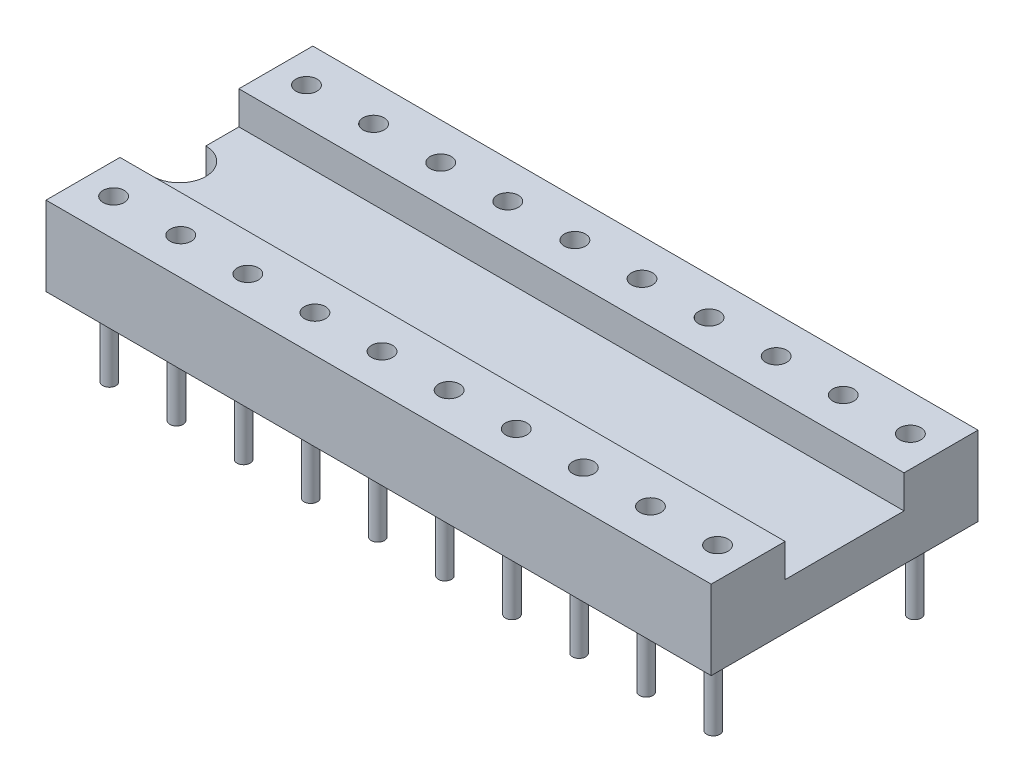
ISO-10303-21;
HEADER;
FILE_DESCRIPTION(('STEP AP214'),'2;1');
FILE_NAME('part.step','',(''),(''),'','','');
FILE_SCHEMA(('AUTOMOTIVE_DESIGN { 1 0 10303 214 1 1 1 1 }'));
ENDSEC;
DATA;
#1=APPLICATION_CONTEXT('core data for automotive mechanical design processes');
#2=APPLICATION_PROTOCOL_DEFINITION('international standard','automotive_design',2000,#1);
#3=PRODUCT_CONTEXT('',#1,'mechanical');
#4=PRODUCT('Part','Part','',(#3));
#5=PRODUCT_RELATED_PRODUCT_CATEGORY('part','',(#4));
#6=PRODUCT_DEFINITION_FORMATION('','',#4);
#7=PRODUCT_DEFINITION_CONTEXT('part definition',#1,'design');
#8=PRODUCT_DEFINITION('design','',#6,#7);
#9=PRODUCT_DEFINITION_SHAPE('','',#8);
#10=(LENGTH_UNIT() NAMED_UNIT(*) SI_UNIT(.MILLI.,.METRE.));
#11=(NAMED_UNIT(*) PLANE_ANGLE_UNIT() SI_UNIT($,.RADIAN.));
#12=(NAMED_UNIT(*) SI_UNIT($,.STERADIAN.) SOLID_ANGLE_UNIT());
#13=UNCERTAINTY_MEASURE_WITH_UNIT(LENGTH_MEASURE(1.E-05),#10,'distance_accuracy_value','');
#14=(GEOMETRIC_REPRESENTATION_CONTEXT(3) GLOBAL_UNCERTAINTY_ASSIGNED_CONTEXT((#13)) GLOBAL_UNIT_ASSIGNED_CONTEXT((#10,
#11,#12)) REPRESENTATION_CONTEXT('',''));
#15=CARTESIAN_POINT('',(0.,0.,0.));
#16=DIRECTION('',(0.,0.,1.));
#17=DIRECTION('',(1.,0.,0.));
#18=AXIS2_PLACEMENT_3D('',#15,#16,#17);
#19=CARTESIAN_POINT('',(25.18,0.,5.05));
#20=DIRECTION('',(0.,1.,0.));
#21=DIRECTION('',(0.,0.,1.));
#22=AXIS2_PLACEMENT_3D('',#19,#20,#21);
#23=PLANE('',#22);
#24=CARTESIAN_POINT('',(24.02,0.,3.81));
#25=DIRECTION('',(0.,1.,0.));
#26=DIRECTION('',(0.,0.,1.));
#27=AXIS2_PLACEMENT_3D('',#24,#25,#26);
#28=CIRCLE('',#27,0.25);
#29=CARTESIAN_POINT('',(24.02,0.,4.06));
#30=VERTEX_POINT('',#29);
#31=EDGE_CURVE('E43',#30,#30,#28,.F.);
#32=ORIENTED_EDGE('',*,*,#31,.F.);
#33=EDGE_LOOP('',(#32));
#34=FACE_BOUND('',#33,.T.);
#35=CARTESIAN_POINT('',(21.48,0.,3.81));
#36=DIRECTION('',(0.,1.,0.));
#37=DIRECTION('',(0.,0.,1.));
#38=AXIS2_PLACEMENT_3D('',#35,#36,#37);
#39=CIRCLE('',#38,0.25);
#40=CARTESIAN_POINT('',(21.48,0.,4.06));
#41=VERTEX_POINT('',#40);
#42=EDGE_CURVE('E226',#41,#41,#39,.F.);
#43=ORIENTED_EDGE('',*,*,#42,.F.);
#44=EDGE_LOOP('',(#43));
#45=FACE_BOUND('',#44,.T.);
#46=CARTESIAN_POINT('',(18.94,0.,3.81));
#47=DIRECTION('',(0.,1.,0.));
#48=DIRECTION('',(0.,0.,1.));
#49=AXIS2_PLACEMENT_3D('',#46,#47,#48);
#50=CIRCLE('',#49,0.25);
#51=CARTESIAN_POINT('',(18.94,0.,4.06));
#52=VERTEX_POINT('',#51);
#53=EDGE_CURVE('E220',#52,#52,#50,.F.);
#54=ORIENTED_EDGE('',*,*,#53,.F.);
#55=EDGE_LOOP('',(#54));
#56=FACE_BOUND('',#55,.T.);
#57=CARTESIAN_POINT('',(16.4,0.,3.81));
#58=DIRECTION('',(0.,1.,0.));
#59=DIRECTION('',(0.,0.,1.));
#60=AXIS2_PLACEMENT_3D('',#57,#58,#59);
#61=CIRCLE('',#60,0.25);
#62=CARTESIAN_POINT('',(16.4,0.,4.06));
#63=VERTEX_POINT('',#62);
#64=EDGE_CURVE('E214',#63,#63,#61,.F.);
#65=ORIENTED_EDGE('',*,*,#64,.F.);
#66=EDGE_LOOP('',(#65));
#67=FACE_BOUND('',#66,.T.);
#68=CARTESIAN_POINT('',(13.86,0.,3.81));
#69=DIRECTION('',(0.,1.,0.));
#70=DIRECTION('',(0.,0.,1.));
#71=AXIS2_PLACEMENT_3D('',#68,#69,#70);
#72=CIRCLE('',#71,0.25);
#73=CARTESIAN_POINT('',(13.86,0.,4.06));
#74=VERTEX_POINT('',#73);
#75=EDGE_CURVE('E208',#74,#74,#72,.F.);
#76=ORIENTED_EDGE('',*,*,#75,.F.);
#77=EDGE_LOOP('',(#76));
#78=FACE_BOUND('',#77,.T.);
#79=CARTESIAN_POINT('',(11.32,0.,3.81));
#80=DIRECTION('',(0.,1.,0.));
#81=DIRECTION('',(0.,0.,1.));
#82=AXIS2_PLACEMENT_3D('',#79,#80,#81);
#83=CIRCLE('',#82,0.25);
#84=CARTESIAN_POINT('',(11.32,0.,4.06));
#85=VERTEX_POINT('',#84);
#86=EDGE_CURVE('E202',#85,#85,#83,.F.);
#87=ORIENTED_EDGE('',*,*,#86,.F.);
#88=EDGE_LOOP('',(#87));
#89=FACE_BOUND('',#88,.T.);
#90=CARTESIAN_POINT('',(8.77999999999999,0.,3.81));
#91=DIRECTION('',(0.,1.,0.));
#92=DIRECTION('',(0.,0.,1.));
#93=AXIS2_PLACEMENT_3D('',#90,#91,#92);
#94=CIRCLE('',#93,0.25);
#95=CARTESIAN_POINT('',(8.77999999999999,0.,4.06));
#96=VERTEX_POINT('',#95);
#97=EDGE_CURVE('E196',#96,#96,#94,.F.);
#98=ORIENTED_EDGE('',*,*,#97,.F.);
#99=EDGE_LOOP('',(#98));
#100=FACE_BOUND('',#99,.T.);
#101=CARTESIAN_POINT('',(6.23999999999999,0.,3.81));
#102=DIRECTION('',(0.,1.,0.));
#103=DIRECTION('',(0.,0.,1.));
#104=AXIS2_PLACEMENT_3D('',#101,#102,#103);
#105=CIRCLE('',#104,0.249999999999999);
#106=CARTESIAN_POINT('',(6.23999999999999,0.,4.06));
#107=VERTEX_POINT('',#106);
#108=EDGE_CURVE('E190',#107,#107,#105,.F.);
#109=ORIENTED_EDGE('',*,*,#108,.F.);
#110=EDGE_LOOP('',(#109));
#111=FACE_BOUND('',#110,.T.);
#112=CARTESIAN_POINT('',(3.7,0.,3.81));
#113=DIRECTION('',(0.,1.,0.));
#114=DIRECTION('',(0.,0.,1.));
#115=AXIS2_PLACEMENT_3D('',#112,#113,#114);
#116=CIRCLE('',#115,0.25);
#117=CARTESIAN_POINT('',(3.7,0.,4.06));
#118=VERTEX_POINT('',#117);
#119=EDGE_CURVE('E184',#118,#118,#116,.F.);
#120=ORIENTED_EDGE('',*,*,#119,.F.);
#121=EDGE_LOOP('',(#120));
#122=FACE_BOUND('',#121,.T.);
#123=CARTESIAN_POINT('',(1.16,0.,3.81));
#124=DIRECTION('',(0.,1.,0.));
#125=DIRECTION('',(0.,0.,1.));
#126=AXIS2_PLACEMENT_3D('',#123,#124,#125);
#127=CIRCLE('',#126,0.25);
#128=CARTESIAN_POINT('',(1.16,0.,4.06));
#129=VERTEX_POINT('',#128);
#130=EDGE_CURVE('E178',#129,#129,#127,.F.);
#131=ORIENTED_EDGE('',*,*,#130,.F.);
#132=EDGE_LOOP('',(#131));
#133=FACE_BOUND('',#132,.T.);
#134=DIRECTION('',(0.,0.,-1.));
#135=VECTOR('',#134,1.);
#136=CARTESIAN_POINT('',(0.,0.,5.05));
#137=LINE('',#136,#135);
#138=CARTESIAN_POINT('',(0.,0.,5.05));
#139=VERTEX_POINT('',#138);
#140=CARTESIAN_POINT('',(0.,0.,1.));
#141=VERTEX_POINT('',#140);
#142=EDGE_CURVE('E156',#139,#141,#137,.T.);
#143=ORIENTED_EDGE('',*,*,#142,.T.);
#144=CARTESIAN_POINT('',(0.,0.,0.));
#145=DIRECTION('',(0.,1.,0.));
#146=DIRECTION('',(0.,0.,1.));
#147=AXIS2_PLACEMENT_3D('',#144,#145,#146);
#148=CIRCLE('',#147,1.);
#149=CARTESIAN_POINT('',(0.,0.,-1.));
#150=VERTEX_POINT('',#149);
#151=EDGE_CURVE('E50',#141,#150,#148,.T.);
#152=ORIENTED_EDGE('',*,*,#151,.T.);
#153=CARTESIAN_POINT('',(0.,0.,-5.05));
#154=VERTEX_POINT('',#153);
#155=EDGE_CURVE('E155',#150,#154,#137,.T.);
#156=ORIENTED_EDGE('',*,*,#155,.T.);
#157=DIRECTION('',(-1.,0.,0.));
#158=VECTOR('',#157,1.);
#159=CARTESIAN_POINT('',(25.18,0.,-5.05));
#160=LINE('',#159,#158);
#161=CARTESIAN_POINT('',(25.18,0.,-5.05));
#162=VERTEX_POINT('',#161);
#163=EDGE_CURVE('E136',#162,#154,#160,.T.);
#164=ORIENTED_EDGE('',*,*,#163,.F.);
#165=DIRECTION('',(0.,0.,-1.));
#166=VECTOR('',#165,1.);
#167=CARTESIAN_POINT('',(25.18,0.,5.05));
#168=LINE('',#167,#166);
#169=CARTESIAN_POINT('',(25.18,0.,5.05));
#170=VERTEX_POINT('',#169);
#171=EDGE_CURVE('E124',#170,#162,#168,.T.);
#172=ORIENTED_EDGE('',*,*,#171,.F.);
#173=DIRECTION('',(-1.,0.,0.));
#174=VECTOR('',#173,1.);
#175=CARTESIAN_POINT('',(25.18,0.,5.05));
#176=LINE('',#175,#174);
#177=EDGE_CURVE('E167',#170,#139,#176,.T.);
#178=ORIENTED_EDGE('',*,*,#177,.T.);
#179=EDGE_LOOP('',(#143,#152,#156,#164,#172,#178));
#180=FACE_BOUND('',#179,.T.);
#181=CARTESIAN_POINT('',(1.16,0.,-3.81));
#182=DIRECTION('',(0.,1.,0.));
#183=DIRECTION('',(0.,0.,1.));
#184=AXIS2_PLACEMENT_3D('',#181,#182,#183);
#185=CIRCLE('',#184,0.25);
#186=CARTESIAN_POINT('',(1.16,0.,-3.56));
#187=VERTEX_POINT('',#186);
#188=EDGE_CURVE('E181',#187,#187,#185,.F.);
#189=ORIENTED_EDGE('',*,*,#188,.F.);
#190=EDGE_LOOP('',(#189));
#191=FACE_BOUND('',#190,.T.);
#192=CARTESIAN_POINT('',(3.7,0.,-3.81));
#193=DIRECTION('',(0.,1.,0.));
#194=DIRECTION('',(0.,0.,1.));
#195=AXIS2_PLACEMENT_3D('',#192,#193,#194);
#196=CIRCLE('',#195,0.25);
#197=CARTESIAN_POINT('',(3.7,0.,-3.56));
#198=VERTEX_POINT('',#197);
#199=EDGE_CURVE('E187',#198,#198,#196,.F.);
#200=ORIENTED_EDGE('',*,*,#199,.F.);
#201=EDGE_LOOP('',(#200));
#202=FACE_BOUND('',#201,.T.);
#203=CARTESIAN_POINT('',(6.23999999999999,0.,-3.81));
#204=DIRECTION('',(0.,1.,0.));
#205=DIRECTION('',(0.,0.,1.));
#206=AXIS2_PLACEMENT_3D('',#203,#204,#205);
#207=CIRCLE('',#206,0.249999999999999);
#208=CARTESIAN_POINT('',(6.23999999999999,0.,-3.56));
#209=VERTEX_POINT('',#208);
#210=EDGE_CURVE('E193',#209,#209,#207,.F.);
#211=ORIENTED_EDGE('',*,*,#210,.F.);
#212=EDGE_LOOP('',(#211));
#213=FACE_BOUND('',#212,.T.);
#214=CARTESIAN_POINT('',(8.77999999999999,0.,-3.81));
#215=DIRECTION('',(0.,1.,0.));
#216=DIRECTION('',(0.,0.,1.));
#217=AXIS2_PLACEMENT_3D('',#214,#215,#216);
#218=CIRCLE('',#217,0.25);
#219=CARTESIAN_POINT('',(8.77999999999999,0.,-3.56));
#220=VERTEX_POINT('',#219);
#221=EDGE_CURVE('E199',#220,#220,#218,.F.);
#222=ORIENTED_EDGE('',*,*,#221,.F.);
#223=EDGE_LOOP('',(#222));
#224=FACE_BOUND('',#223,.T.);
#225=CARTESIAN_POINT('',(11.32,0.,-3.81));
#226=DIRECTION('',(0.,1.,0.));
#227=DIRECTION('',(0.,0.,1.));
#228=AXIS2_PLACEMENT_3D('',#225,#226,#227);
#229=CIRCLE('',#228,0.25);
#230=CARTESIAN_POINT('',(11.32,0.,-3.56));
#231=VERTEX_POINT('',#230);
#232=EDGE_CURVE('E205',#231,#231,#229,.F.);
#233=ORIENTED_EDGE('',*,*,#232,.F.);
#234=EDGE_LOOP('',(#233));
#235=FACE_BOUND('',#234,.T.);
#236=CARTESIAN_POINT('',(13.86,0.,-3.81));
#237=DIRECTION('',(0.,1.,0.));
#238=DIRECTION('',(0.,0.,1.));
#239=AXIS2_PLACEMENT_3D('',#236,#237,#238);
#240=CIRCLE('',#239,0.25);
#241=CARTESIAN_POINT('',(13.86,0.,-3.56));
#242=VERTEX_POINT('',#241);
#243=EDGE_CURVE('E211',#242,#242,#240,.F.);
#244=ORIENTED_EDGE('',*,*,#243,.F.);
#245=EDGE_LOOP('',(#244));
#246=FACE_BOUND('',#245,.T.);
#247=CARTESIAN_POINT('',(16.4,0.,-3.81));
#248=DIRECTION('',(0.,1.,0.));
#249=DIRECTION('',(0.,0.,1.));
#250=AXIS2_PLACEMENT_3D('',#247,#248,#249);
#251=CIRCLE('',#250,0.25);
#252=CARTESIAN_POINT('',(16.4,0.,-3.56));
#253=VERTEX_POINT('',#252);
#254=EDGE_CURVE('E217',#253,#253,#251,.F.);
#255=ORIENTED_EDGE('',*,*,#254,.F.);
#256=EDGE_LOOP('',(#255));
#257=FACE_BOUND('',#256,.T.);
#258=CARTESIAN_POINT('',(18.94,0.,-3.81));
#259=DIRECTION('',(0.,1.,0.));
#260=DIRECTION('',(0.,0.,1.));
#261=AXIS2_PLACEMENT_3D('',#258,#259,#260);
#262=CIRCLE('',#261,0.25);
#263=CARTESIAN_POINT('',(18.94,0.,-3.56));
#264=VERTEX_POINT('',#263);
#265=EDGE_CURVE('E223',#264,#264,#262,.F.);
#266=ORIENTED_EDGE('',*,*,#265,.F.);
#267=EDGE_LOOP('',(#266));
#268=FACE_BOUND('',#267,.T.);
#269=CARTESIAN_POINT('',(21.48,0.,-3.81));
#270=DIRECTION('',(0.,1.,0.));
#271=DIRECTION('',(0.,0.,1.));
#272=AXIS2_PLACEMENT_3D('',#269,#270,#271);
#273=CIRCLE('',#272,0.25);
#274=CARTESIAN_POINT('',(21.48,0.,-3.56));
#275=VERTEX_POINT('',#274);
#276=EDGE_CURVE('E229',#275,#275,#273,.F.);
#277=ORIENTED_EDGE('',*,*,#276,.F.);
#278=EDGE_LOOP('',(#277));
#279=FACE_BOUND('',#278,.T.);
#280=CARTESIAN_POINT('',(24.02,0.,-3.81));
#281=DIRECTION('',(0.,1.,0.));
#282=DIRECTION('',(0.,0.,1.));
#283=AXIS2_PLACEMENT_3D('',#280,#281,#282);
#284=CIRCLE('',#283,0.25);
#285=CARTESIAN_POINT('',(24.02,0.,-3.56));
#286=VERTEX_POINT('',#285);
#287=EDGE_CURVE('E11',#286,#286,#284,.F.);
#288=ORIENTED_EDGE('',*,*,#287,.F.);
#289=EDGE_LOOP('',(#288));
#290=FACE_BOUND('',#289,.T.);
#291=ADVANCED_FACE('F35',(#34,#45,#56,#67,#78,#89,#100,#111,#122,#133,#180,#191,#202,#213,#224,
#235,#246,#257,#268,#279,#290),#23,.F.);
#292=CARTESIAN_POINT('',(0.,1.75,5.05));
#293=DIRECTION('',(1.,0.,0.));
#294=DIRECTION('',(0.,0.,-1.));
#295=AXIS2_PLACEMENT_3D('',#292,#293,#294);
#296=PLANE('',#295);
#297=ORIENTED_EDGE('',*,*,#155,.F.);
#298=DIRECTION('',(0.,1.,0.));
#299=VECTOR('',#298,1.);
#300=CARTESIAN_POINT('',(0.,0.,-1.));
#301=LINE('',#300,#299);
#302=CARTESIAN_POINT('',(0.,1.75,-1.));
#303=VERTEX_POINT('',#302);
#304=EDGE_CURVE('E650',#150,#303,#301,.T.);
#305=ORIENTED_EDGE('',*,*,#304,.T.);
#306=DIRECTION('',(0.,0.,1.));
#307=VECTOR('',#306,1.);
#308=CARTESIAN_POINT('',(0.,1.75,-2.25));
#309=LINE('',#308,#307);
#310=CARTESIAN_POINT('',(0.,1.75,-2.25));
#311=VERTEX_POINT('',#310);
#312=EDGE_CURVE('E145',#311,#303,#309,.T.);
#313=ORIENTED_EDGE('',*,*,#312,.F.);
#314=DIRECTION('',(0.,-1.,0.));
#315=VECTOR('',#314,1.);
#316=CARTESIAN_POINT('',(0.,3.,-2.25));
#317=LINE('',#316,#315);
#318=CARTESIAN_POINT('',(0.,3.,-2.25));
#319=VERTEX_POINT('',#318);
#320=EDGE_CURVE('E92',#319,#311,#317,.T.);
#321=ORIENTED_EDGE('',*,*,#320,.F.);
#322=DIRECTION('',(0.,0.,1.));
#323=VECTOR('',#322,1.);
#324=CARTESIAN_POINT('',(0.,3.,-5.05));
#325=LINE('',#324,#323);
#326=CARTESIAN_POINT('',(0.,3.,-5.05));
#327=VERTEX_POINT('',#326);
#328=EDGE_CURVE('E160',#327,#319,#325,.T.);
#329=ORIENTED_EDGE('',*,*,#328,.F.);
#330=DIRECTION('',(0.,1.,0.));
#331=VECTOR('',#330,1.);
#332=CARTESIAN_POINT('',(0.,0.,-5.05));
#333=LINE('',#332,#331);
#334=EDGE_CURVE('E133',#154,#327,#333,.T.);
#335=ORIENTED_EDGE('',*,*,#334,.F.);
#336=EDGE_LOOP('',(#297,#305,#313,#321,#329,#335));
#337=FACE_BOUND('',#336,.T.);
#338=ADVANCED_FACE('F238',(#337),#296,.F.);
#339=CARTESIAN_POINT('',(25.18,1.75,-2.25));
#340=DIRECTION('',(0.,-1.,0.));
#341=DIRECTION('',(0.,0.,-1.));
#342=AXIS2_PLACEMENT_3D('',#339,#340,#341);
#343=PLANE('',#342);
#344=ORIENTED_EDGE('',*,*,#312,.T.);
#345=CARTESIAN_POINT('',(0.,1.75,0.));
#346=DIRECTION('',(0.,1.,0.));
#347=DIRECTION('',(0.,0.,1.));
#348=AXIS2_PLACEMENT_3D('',#345,#346,#347);
#349=CIRCLE('',#348,1.);
#350=CARTESIAN_POINT('',(0.,1.75,1.));
#351=VERTEX_POINT('',#350);
#352=EDGE_CURVE('E655',#351,#303,#349,.T.);
#353=ORIENTED_EDGE('',*,*,#352,.F.);
#354=CARTESIAN_POINT('',(0.,1.75,2.25));
#355=VERTEX_POINT('',#354);
#356=EDGE_CURVE('E149',#351,#355,#309,.T.);
#357=ORIENTED_EDGE('',*,*,#356,.T.);
#358=DIRECTION('',(-1.,0.,0.));
#359=VECTOR('',#358,1.);
#360=CARTESIAN_POINT('',(25.18,1.75,2.25));
#361=LINE('',#360,#359);
#362=CARTESIAN_POINT('',(25.18,1.75,2.25));
#363=VERTEX_POINT('',#362);
#364=EDGE_CURVE('E176',#363,#355,#361,.T.);
#365=ORIENTED_EDGE('',*,*,#364,.F.);
#366=DIRECTION('',(0.,0.,1.));
#367=VECTOR('',#366,1.);
#368=CARTESIAN_POINT('',(25.18,1.75,-2.25));
#369=LINE('',#368,#367);
#370=CARTESIAN_POINT('',(25.18,1.75,-2.25));
#371=VERTEX_POINT('',#370);
#372=EDGE_CURVE('E163',#371,#363,#369,.T.);
#373=ORIENTED_EDGE('',*,*,#372,.F.);
#374=DIRECTION('',(-1.,0.,0.));
#375=VECTOR('',#374,1.);
#376=CARTESIAN_POINT('',(25.18,1.75,-2.25));
#377=LINE('',#376,#375);
#378=EDGE_CURVE('E141',#371,#311,#377,.T.);
#379=ORIENTED_EDGE('',*,*,#378,.T.);
#380=EDGE_LOOP('',(#344,#353,#357,#365,#373,#379));
#381=FACE_BOUND('',#380,.T.);
#382=ADVANCED_FACE('F37',(#381),#343,.F.);
#383=CARTESIAN_POINT('',(25.18,1.75,2.25));
#384=DIRECTION('',(0.,0.,1.));
#385=DIRECTION('',(0.,-1.,0.));
#386=AXIS2_PLACEMENT_3D('',#383,#384,#385);
#387=PLANE('',#386);
#388=DIRECTION('',(0.,1.,0.));
#389=VECTOR('',#388,1.);
#390=CARTESIAN_POINT('',(0.,1.75,2.25));
#391=LINE('',#390,#389);
#392=CARTESIAN_POINT('',(0.,3.,2.25));
#393=VERTEX_POINT('',#392);
#394=EDGE_CURVE('E148',#355,#393,#391,.T.);
#395=ORIENTED_EDGE('',*,*,#394,.T.);
#396=DIRECTION('',(-1.,0.,0.));
#397=VECTOR('',#396,1.);
#398=CARTESIAN_POINT('',(25.18,3.,2.25));
#399=LINE('',#398,#397);
#400=CARTESIAN_POINT('',(25.18,3.,2.25));
#401=VERTEX_POINT('',#400);
#402=EDGE_CURVE('E173',#401,#393,#399,.T.);
#403=ORIENTED_EDGE('',*,*,#402,.F.);
#404=DIRECTION('',(0.,1.,0.));
#405=VECTOR('',#404,1.);
#406=CARTESIAN_POINT('',(25.18,1.75,2.25));
#407=LINE('',#406,#405);
#408=EDGE_CURVE('E101',#363,#401,#407,.T.);
#409=ORIENTED_EDGE('',*,*,#408,.F.);
#410=ORIENTED_EDGE('',*,*,#364,.T.);
#411=EDGE_LOOP('',(#395,#403,#409,#410));
#412=FACE_BOUND('',#411,.T.);
#413=ADVANCED_FACE('F626',(#412),#387,.F.);
#414=CARTESIAN_POINT('',(25.18,3.,2.25));
#415=DIRECTION('',(0.,-1.,0.));
#416=DIRECTION('',(0.,0.,-1.));
#417=AXIS2_PLACEMENT_3D('',#414,#415,#416);
#418=PLANE('',#417);
#419=CARTESIAN_POINT('',(24.02,3.,3.64999999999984));
#420=DIRECTION('',(0.,1.,0.));
#421=DIRECTION('',(0.,0.,1.));
#422=AXIS2_PLACEMENT_3D('',#419,#420,#421);
#423=CIRCLE('',#422,0.400000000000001);
#424=CARTESIAN_POINT('',(24.02,3.,4.04999999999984));
#425=VERTEX_POINT('',#424);
#426=EDGE_CURVE('E768',#425,#425,#423,.T.);
#427=ORIENTED_EDGE('',*,*,#426,.F.);
#428=EDGE_LOOP('',(#427));
#429=FACE_BOUND('',#428,.T.);
#430=CARTESIAN_POINT('',(21.48,3.,3.64999999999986));
#431=DIRECTION('',(0.,1.,0.));
#432=DIRECTION('',(0.,0.,1.));
#433=AXIS2_PLACEMENT_3D('',#430,#431,#432);
#434=CIRCLE('',#433,0.400000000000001);
#435=CARTESIAN_POINT('',(21.48,3.,4.04999999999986));
#436=VERTEX_POINT('',#435);
#437=EDGE_CURVE('E756',#436,#436,#434,.T.);
#438=ORIENTED_EDGE('',*,*,#437,.F.);
#439=EDGE_LOOP('',(#438));
#440=FACE_BOUND('',#439,.T.);
#441=CARTESIAN_POINT('',(18.94,3.,3.64999999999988));
#442=DIRECTION('',(0.,1.,0.));
#443=DIRECTION('',(0.,0.,1.));
#444=AXIS2_PLACEMENT_3D('',#441,#442,#443);
#445=CIRCLE('',#444,0.400000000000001);
#446=CARTESIAN_POINT('',(18.94,3.,4.04999999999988));
#447=VERTEX_POINT('',#446);
#448=EDGE_CURVE('E744',#447,#447,#445,.T.);
#449=ORIENTED_EDGE('',*,*,#448,.F.);
#450=EDGE_LOOP('',(#449));
#451=FACE_BOUND('',#450,.T.);
#452=CARTESIAN_POINT('',(16.4,3.,3.64999999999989));
#453=DIRECTION('',(0.,1.,0.));
#454=DIRECTION('',(0.,0.,1.));
#455=AXIS2_PLACEMENT_3D('',#452,#453,#454);
#456=CIRCLE('',#455,0.400000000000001);
#457=CARTESIAN_POINT('',(16.4,3.,4.0499999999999));
#458=VERTEX_POINT('',#457);
#459=EDGE_CURVE('E732',#458,#458,#456,.T.);
#460=ORIENTED_EDGE('',*,*,#459,.F.);
#461=EDGE_LOOP('',(#460));
#462=FACE_BOUND('',#461,.T.);
#463=CARTESIAN_POINT('',(13.86,3.,3.64999999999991));
#464=DIRECTION('',(0.,1.,0.));
#465=DIRECTION('',(0.,0.,1.));
#466=AXIS2_PLACEMENT_3D('',#463,#464,#465);
#467=CIRCLE('',#466,0.4);
#468=CARTESIAN_POINT('',(13.86,3.,4.04999999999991));
#469=VERTEX_POINT('',#468);
#470=EDGE_CURVE('E720',#469,#469,#467,.T.);
#471=ORIENTED_EDGE('',*,*,#470,.F.);
#472=EDGE_LOOP('',(#471));
#473=FACE_BOUND('',#472,.T.);
#474=CARTESIAN_POINT('',(11.32,3.,3.64999999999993));
#475=DIRECTION('',(0.,1.,0.));
#476=DIRECTION('',(0.,0.,1.));
#477=AXIS2_PLACEMENT_3D('',#474,#475,#476);
#478=CIRCLE('',#477,0.4);
#479=CARTESIAN_POINT('',(11.32,3.,4.04999999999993));
#480=VERTEX_POINT('',#479);
#481=EDGE_CURVE('E708',#480,#480,#478,.T.);
#482=ORIENTED_EDGE('',*,*,#481,.F.);
#483=EDGE_LOOP('',(#482));
#484=FACE_BOUND('',#483,.T.);
#485=CARTESIAN_POINT('',(8.78,3.,3.64999999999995));
#486=DIRECTION('',(0.,1.,0.));
#487=DIRECTION('',(0.,0.,1.));
#488=AXIS2_PLACEMENT_3D('',#485,#486,#487);
#489=CIRCLE('',#488,0.4);
#490=CARTESIAN_POINT('',(8.78,3.,4.04999999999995));
#491=VERTEX_POINT('',#490);
#492=EDGE_CURVE('E696',#491,#491,#489,.T.);
#493=ORIENTED_EDGE('',*,*,#492,.F.);
#494=EDGE_LOOP('',(#493));
#495=FACE_BOUND('',#494,.T.);
#496=CARTESIAN_POINT('',(6.24,3.,3.64999999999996));
#497=DIRECTION('',(0.,1.,0.));
#498=DIRECTION('',(0.,0.,1.));
#499=AXIS2_PLACEMENT_3D('',#496,#497,#498);
#500=CIRCLE('',#499,0.4);
#501=CARTESIAN_POINT('',(6.24,3.,4.04999999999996));
#502=VERTEX_POINT('',#501);
#503=EDGE_CURVE('E684',#502,#502,#500,.T.);
#504=ORIENTED_EDGE('',*,*,#503,.F.);
#505=EDGE_LOOP('',(#504));
#506=FACE_BOUND('',#505,.T.);
#507=CARTESIAN_POINT('',(3.7,3.,3.64999999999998));
#508=DIRECTION('',(0.,1.,0.));
#509=DIRECTION('',(0.,0.,1.));
#510=AXIS2_PLACEMENT_3D('',#507,#508,#509);
#511=CIRCLE('',#510,0.4);
#512=CARTESIAN_POINT('',(3.7,3.,4.04999999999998));
#513=VERTEX_POINT('',#512);
#514=EDGE_CURVE('E672',#513,#513,#511,.T.);
#515=ORIENTED_EDGE('',*,*,#514,.F.);
#516=EDGE_LOOP('',(#515));
#517=FACE_BOUND('',#516,.T.);
#518=CARTESIAN_POINT('',(1.16,3.,3.65));
#519=DIRECTION('',(0.,1.,0.));
#520=DIRECTION('',(0.,0.,1.));
#521=AXIS2_PLACEMENT_3D('',#518,#519,#520);
#522=CIRCLE('',#521,0.4);
#523=CARTESIAN_POINT('',(1.16,3.,4.05));
#524=VERTEX_POINT('',#523);
#525=EDGE_CURVE('E660',#524,#524,#522,.T.);
#526=ORIENTED_EDGE('',*,*,#525,.F.);
#527=EDGE_LOOP('',(#526));
#528=FACE_BOUND('',#527,.T.);
#529=DIRECTION('',(0.,0.,1.));
#530=VECTOR('',#529,1.);
#531=CARTESIAN_POINT('',(0.,3.,2.25));
#532=LINE('',#531,#530);
#533=CARTESIAN_POINT('',(0.,3.,5.05));
#534=VERTEX_POINT('',#533);
#535=EDGE_CURVE('E151',#393,#534,#532,.T.);
#536=ORIENTED_EDGE('',*,*,#535,.T.);
#537=DIRECTION('',(-1.,0.,0.));
#538=VECTOR('',#537,1.);
#539=CARTESIAN_POINT('',(25.18,3.,5.05));
#540=LINE('',#539,#538);
#541=CARTESIAN_POINT('',(25.18,3.,5.05));
#542=VERTEX_POINT('',#541);
#543=EDGE_CURVE('E170',#542,#534,#540,.T.);
#544=ORIENTED_EDGE('',*,*,#543,.F.);
#545=DIRECTION('',(0.,0.,1.));
#546=VECTOR('',#545,1.);
#547=CARTESIAN_POINT('',(25.18,3.,2.25));
#548=LINE('',#547,#546);
#549=EDGE_CURVE('E640',#401,#542,#548,.T.);
#550=ORIENTED_EDGE('',*,*,#549,.F.);
#551=ORIENTED_EDGE('',*,*,#402,.T.);
#552=EDGE_LOOP('',(#536,#544,#550,#551));
#553=FACE_BOUND('',#552,.T.);
#554=ADVANCED_FACE('F623',(#429,#440,#451,#462,#473,#484,#495,#506,#517,#528,#553),#418,.F.);
#555=CARTESIAN_POINT('',(25.18,3.,5.05));
#556=DIRECTION('',(0.,0.,-1.));
#557=DIRECTION('',(-1.,0.,0.));
#558=AXIS2_PLACEMENT_3D('',#555,#556,#557);
#559=PLANE('',#558);
#560=DIRECTION('',(0.,-1.,0.));
#561=VECTOR('',#560,1.);
#562=CARTESIAN_POINT('',(0.,3.,5.05));
#563=LINE('',#562,#561);
#564=EDGE_CURVE('E153',#534,#139,#563,.T.);
#565=ORIENTED_EDGE('',*,*,#564,.T.);
#566=ORIENTED_EDGE('',*,*,#177,.F.);
#567=DIRECTION('',(0.,-1.,0.));
#568=VECTOR('',#567,1.);
#569=CARTESIAN_POINT('',(25.18,3.,5.05));
#570=LINE('',#569,#568);
#571=EDGE_CURVE('E644',#542,#170,#570,.T.);
#572=ORIENTED_EDGE('',*,*,#571,.F.);
#573=ORIENTED_EDGE('',*,*,#543,.T.);
#574=EDGE_LOOP('',(#565,#566,#572,#573));
#575=FACE_BOUND('',#574,.T.);
#576=ADVANCED_FACE('F619',(#575),#559,.F.);
#577=CARTESIAN_POINT('',(25.18,0.,-5.05));
#578=DIRECTION('',(0.,0.,1.));
#579=DIRECTION('',(0.,-1.,0.));
#580=AXIS2_PLACEMENT_3D('',#577,#578,#579);
#581=PLANE('',#580);
#582=ORIENTED_EDGE('',*,*,#334,.T.);
#583=DIRECTION('',(-1.,0.,0.));
#584=VECTOR('',#583,1.);
#585=CARTESIAN_POINT('',(25.18,3.,-5.05));
#586=LINE('',#585,#584);
#587=CARTESIAN_POINT('',(25.18,3.,-5.05));
#588=VERTEX_POINT('',#587);
#589=EDGE_CURVE('E130',#588,#327,#586,.T.);
#590=ORIENTED_EDGE('',*,*,#589,.F.);
#591=DIRECTION('',(0.,1.,0.));
#592=VECTOR('',#591,1.);
#593=CARTESIAN_POINT('',(25.18,0.,-5.05));
#594=LINE('',#593,#592);
#595=EDGE_CURVE('E117',#162,#588,#594,.T.);
#596=ORIENTED_EDGE('',*,*,#595,.F.);
#597=ORIENTED_EDGE('',*,*,#163,.T.);
#598=EDGE_LOOP('',(#582,#590,#596,#597));
#599=FACE_BOUND('',#598,.T.);
#600=ADVANCED_FACE('F131',(#599),#581,.F.);
#601=CARTESIAN_POINT('',(25.18,3.,-5.05));
#602=DIRECTION('',(0.,-1.,0.));
#603=DIRECTION('',(0.,0.,-1.));
#604=AXIS2_PLACEMENT_3D('',#601,#602,#603);
#605=PLANE('',#604);
#606=CARTESIAN_POINT('',(24.02,3.,-3.65000000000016));
#607=DIRECTION('',(0.,1.,0.));
#608=DIRECTION('',(0.,0.,-1.));
#609=AXIS2_PLACEMENT_3D('',#606,#607,#608);
#610=CIRCLE('',#609,0.400000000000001);
#611=CARTESIAN_POINT('',(24.02,3.,-4.05000000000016));
#612=VERTEX_POINT('',#611);
#613=EDGE_CURVE('E774',#612,#612,#610,.T.);
#614=ORIENTED_EDGE('',*,*,#613,.F.);
#615=EDGE_LOOP('',(#614));
#616=FACE_BOUND('',#615,.T.);
#617=CARTESIAN_POINT('',(21.48,3.,-3.65000000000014));
#618=DIRECTION('',(0.,1.,0.));
#619=DIRECTION('',(0.,0.,-1.));
#620=AXIS2_PLACEMENT_3D('',#617,#618,#619);
#621=CIRCLE('',#620,0.400000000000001);
#622=CARTESIAN_POINT('',(21.48,3.,-4.05000000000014));
#623=VERTEX_POINT('',#622);
#624=EDGE_CURVE('E762',#623,#623,#621,.T.);
#625=ORIENTED_EDGE('',*,*,#624,.F.);
#626=EDGE_LOOP('',(#625));
#627=FACE_BOUND('',#626,.T.);
#628=CARTESIAN_POINT('',(18.94,3.,-3.65000000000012));
#629=DIRECTION('',(0.,1.,0.));
#630=DIRECTION('',(0.,0.,-1.));
#631=AXIS2_PLACEMENT_3D('',#628,#629,#630);
#632=CIRCLE('',#631,0.400000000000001);
#633=CARTESIAN_POINT('',(18.94,3.,-4.05000000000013));
#634=VERTEX_POINT('',#633);
#635=EDGE_CURVE('E750',#634,#634,#632,.T.);
#636=ORIENTED_EDGE('',*,*,#635,.F.);
#637=EDGE_LOOP('',(#636));
#638=FACE_BOUND('',#637,.T.);
#639=CARTESIAN_POINT('',(16.4,3.,-3.65000000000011));
#640=DIRECTION('',(0.,1.,0.));
#641=DIRECTION('',(0.,0.,-1.));
#642=AXIS2_PLACEMENT_3D('',#639,#640,#641);
#643=CIRCLE('',#642,0.400000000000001);
#644=CARTESIAN_POINT('',(16.4,3.,-4.05000000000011));
#645=VERTEX_POINT('',#644);
#646=EDGE_CURVE('E738',#645,#645,#643,.T.);
#647=ORIENTED_EDGE('',*,*,#646,.F.);
#648=EDGE_LOOP('',(#647));
#649=FACE_BOUND('',#648,.T.);
#650=CARTESIAN_POINT('',(13.86,3.,-3.65000000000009));
#651=DIRECTION('',(0.,1.,0.));
#652=DIRECTION('',(0.,0.,-1.));
#653=AXIS2_PLACEMENT_3D('',#650,#651,#652);
#654=CIRCLE('',#653,0.4);
#655=CARTESIAN_POINT('',(13.86,3.,-4.05000000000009));
#656=VERTEX_POINT('',#655);
#657=EDGE_CURVE('E726',#656,#656,#654,.T.);
#658=ORIENTED_EDGE('',*,*,#657,.F.);
#659=EDGE_LOOP('',(#658));
#660=FACE_BOUND('',#659,.T.);
#661=CARTESIAN_POINT('',(11.32,3.,-3.65000000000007));
#662=DIRECTION('',(0.,1.,0.));
#663=DIRECTION('',(0.,0.,-1.));
#664=AXIS2_PLACEMENT_3D('',#661,#662,#663);
#665=CIRCLE('',#664,0.4);
#666=CARTESIAN_POINT('',(11.32,3.,-4.05000000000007));
#667=VERTEX_POINT('',#666);
#668=EDGE_CURVE('E714',#667,#667,#665,.T.);
#669=ORIENTED_EDGE('',*,*,#668,.F.);
#670=EDGE_LOOP('',(#669));
#671=FACE_BOUND('',#670,.T.);
#672=CARTESIAN_POINT('',(8.78,3.,-3.65000000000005));
#673=DIRECTION('',(0.,1.,0.));
#674=DIRECTION('',(0.,0.,-1.));
#675=AXIS2_PLACEMENT_3D('',#672,#673,#674);
#676=CIRCLE('',#675,0.4);
#677=CARTESIAN_POINT('',(8.78,3.,-4.05000000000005));
#678=VERTEX_POINT('',#677);
#679=EDGE_CURVE('E702',#678,#678,#676,.T.);
#680=ORIENTED_EDGE('',*,*,#679,.F.);
#681=EDGE_LOOP('',(#680));
#682=FACE_BOUND('',#681,.T.);
#683=CARTESIAN_POINT('',(6.24,3.,-3.65000000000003));
#684=DIRECTION('',(0.,1.,0.));
#685=DIRECTION('',(0.,0.,-1.));
#686=AXIS2_PLACEMENT_3D('',#683,#684,#685);
#687=CIRCLE('',#686,0.4);
#688=CARTESIAN_POINT('',(6.24,3.,-4.05000000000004));
#689=VERTEX_POINT('',#688);
#690=EDGE_CURVE('E690',#689,#689,#687,.T.);
#691=ORIENTED_EDGE('',*,*,#690,.F.);
#692=EDGE_LOOP('',(#691));
#693=FACE_BOUND('',#692,.T.);
#694=CARTESIAN_POINT('',(3.7,3.,-3.65000000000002));
#695=DIRECTION('',(0.,1.,0.));
#696=DIRECTION('',(0.,0.,-1.));
#697=AXIS2_PLACEMENT_3D('',#694,#695,#696);
#698=CIRCLE('',#697,0.4);
#699=CARTESIAN_POINT('',(3.7,3.,-4.05000000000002));
#700=VERTEX_POINT('',#699);
#701=EDGE_CURVE('E678',#700,#700,#698,.T.);
#702=ORIENTED_EDGE('',*,*,#701,.F.);
#703=EDGE_LOOP('',(#702));
#704=FACE_BOUND('',#703,.T.);
#705=CARTESIAN_POINT('',(1.16,3.,-3.65));
#706=DIRECTION('',(0.,1.,0.));
#707=DIRECTION('',(0.,0.,-1.));
#708=AXIS2_PLACEMENT_3D('',#705,#706,#707);
#709=CIRCLE('',#708,0.4);
#710=CARTESIAN_POINT('',(1.16,3.,-4.05));
#711=VERTEX_POINT('',#710);
#712=EDGE_CURVE('E666',#711,#711,#709,.T.);
#713=ORIENTED_EDGE('',*,*,#712,.F.);
#714=EDGE_LOOP('',(#713));
#715=FACE_BOUND('',#714,.T.);
#716=ORIENTED_EDGE('',*,*,#328,.T.);
#717=DIRECTION('',(-1.,0.,0.));
#718=VECTOR('',#717,1.);
#719=CARTESIAN_POINT('',(25.18,3.,-2.25));
#720=LINE('',#719,#718);
#721=CARTESIAN_POINT('',(25.18,3.,-2.25));
#722=VERTEX_POINT('',#721);
#723=EDGE_CURVE('E137',#722,#319,#720,.T.);
#724=ORIENTED_EDGE('',*,*,#723,.F.);
#725=DIRECTION('',(0.,0.,1.));
#726=VECTOR('',#725,1.);
#727=CARTESIAN_POINT('',(25.18,3.,-5.05));
#728=LINE('',#727,#726);
#729=EDGE_CURVE('E121',#588,#722,#728,.T.);
#730=ORIENTED_EDGE('',*,*,#729,.F.);
#731=ORIENTED_EDGE('',*,*,#589,.T.);
#732=EDGE_LOOP('',(#716,#724,#730,#731));
#733=FACE_BOUND('',#732,.T.);
#734=ADVANCED_FACE('F139',(#616,#627,#638,#649,#660,#671,#682,#693,#704,#715,#733),#605,.F.);
#735=CARTESIAN_POINT('',(25.18,3.,-2.25));
#736=DIRECTION('',(0.,0.,-1.));
#737=DIRECTION('',(0.,1.,0.));
#738=AXIS2_PLACEMENT_3D('',#735,#736,#737);
#739=PLANE('',#738);
#740=ORIENTED_EDGE('',*,*,#320,.T.);
#741=ORIENTED_EDGE('',*,*,#378,.F.);
#742=DIRECTION('',(0.,-1.,0.));
#743=VECTOR('',#742,1.);
#744=CARTESIAN_POINT('',(25.18,3.,-2.25));
#745=LINE('',#744,#743);
#746=EDGE_CURVE('E59',#722,#371,#745,.T.);
#747=ORIENTED_EDGE('',*,*,#746,.F.);
#748=ORIENTED_EDGE('',*,*,#723,.T.);
#749=EDGE_LOOP('',(#740,#741,#747,#748));
#750=FACE_BOUND('',#749,.T.);
#751=ADVANCED_FACE('F609',(#750),#739,.F.);
#752=CARTESIAN_POINT('',(25.18,1.75,5.05));
#753=DIRECTION('',(1.,0.,0.));
#754=DIRECTION('',(0.,0.,-1.));
#755=AXIS2_PLACEMENT_3D('',#752,#753,#754);
#756=PLANE('',#755);
#757=ORIENTED_EDGE('',*,*,#372,.T.);
#758=ORIENTED_EDGE('',*,*,#408,.T.);
#759=ORIENTED_EDGE('',*,*,#549,.T.);
#760=ORIENTED_EDGE('',*,*,#571,.T.);
#761=ORIENTED_EDGE('',*,*,#171,.T.);
#762=ORIENTED_EDGE('',*,*,#595,.T.);
#763=ORIENTED_EDGE('',*,*,#729,.T.);
#764=ORIENTED_EDGE('',*,*,#746,.T.);
#765=EDGE_LOOP('',(#757,#758,#759,#760,#761,#762,#763,#764));
#766=FACE_BOUND('',#765,.T.);
#767=ADVANCED_FACE('F119',(#766),#756,.T.);
#768=ORIENTED_EDGE('',*,*,#356,.F.);
#769=DIRECTION('',(0.,1.,0.));
#770=VECTOR('',#769,1.);
#771=CARTESIAN_POINT('',(0.,0.,1.));
#772=LINE('',#771,#770);
#773=EDGE_CURVE('E653',#141,#351,#772,.T.);
#774=ORIENTED_EDGE('',*,*,#773,.F.);
#775=ORIENTED_EDGE('',*,*,#142,.F.);
#776=ORIENTED_EDGE('',*,*,#564,.F.);
#777=ORIENTED_EDGE('',*,*,#535,.F.);
#778=ORIENTED_EDGE('',*,*,#394,.F.);
#779=EDGE_LOOP('',(#768,#774,#775,#776,#777,#778));
#780=FACE_BOUND('',#779,.T.);
#781=ADVANCED_FACE('F606',(#780),#296,.F.);
#782=CARTESIAN_POINT('',(0.,0.,0.));
#783=DIRECTION('',(0.,1.,0.));
#784=DIRECTION('',(0.,0.,1.));
#785=AXIS2_PLACEMENT_3D('',#782,#783,#784);
#786=CYLINDRICAL_SURFACE('',#785,1.);
#787=ORIENTED_EDGE('',*,*,#352,.T.);
#788=ORIENTED_EDGE('',*,*,#304,.F.);
#789=ORIENTED_EDGE('',*,*,#151,.F.);
#790=ORIENTED_EDGE('',*,*,#773,.T.);
#791=EDGE_LOOP('',(#787,#788,#789,#790));
#792=FACE_BOUND('',#791,.T.);
#793=ADVANCED_FACE('F602',(#792),#786,.F.);
#794=CARTESIAN_POINT('',(1.16,0.5,3.65));
#795=DIRECTION('',(0.,1.,0.));
#796=DIRECTION('',(0.,0.,1.));
#797=AXIS2_PLACEMENT_3D('',#794,#795,#796);
#798=CYLINDRICAL_SURFACE('',#797,0.4);
#799=CARTESIAN_POINT('',(1.16,0.5,3.65));
#800=DIRECTION('',(0.,1.,0.));
#801=DIRECTION('',(0.,0.,1.));
#802=AXIS2_PLACEMENT_3D('',#799,#800,#801);
#803=CIRCLE('',#802,0.4);
#804=CARTESIAN_POINT('',(1.16,0.5,4.05));
#805=VERTEX_POINT('',#804);
#806=EDGE_CURVE('E658',#805,#805,#803,.T.);
#807=ORIENTED_EDGE('',*,*,#806,.F.);
#808=EDGE_LOOP('',(#807));
#809=FACE_BOUND('',#808,.T.);
#810=ORIENTED_EDGE('',*,*,#525,.T.);
#811=EDGE_LOOP('',(#810));
#812=FACE_BOUND('',#811,.T.);
#813=ADVANCED_FACE('F598',(#809,#812),#798,.F.);
#814=CARTESIAN_POINT('',(1.16,0.5,3.65));
#815=DIRECTION('',(0.,1.,0.));
#816=DIRECTION('',(0.,0.,1.));
#817=AXIS2_PLACEMENT_3D('',#814,#815,#816);
#818=PLANE('',#817);
#819=ORIENTED_EDGE('',*,*,#806,.T.);
#820=EDGE_LOOP('',(#819));
#821=FACE_BOUND('',#820,.T.);
#822=ADVANCED_FACE('F594',(#821),#818,.T.);
#823=CARTESIAN_POINT('',(1.16,0.5,-3.65));
#824=DIRECTION('',(0.,1.,0.));
#825=DIRECTION('',(0.,0.,1.));
#826=AXIS2_PLACEMENT_3D('',#823,#824,#825);
#827=CYLINDRICAL_SURFACE('',#826,0.4);
#828=CARTESIAN_POINT('',(1.16,0.5,-3.65));
#829=DIRECTION('',(0.,1.,0.));
#830=DIRECTION('',(0.,0.,-1.));
#831=AXIS2_PLACEMENT_3D('',#828,#829,#830);
#832=CIRCLE('',#831,0.4);
#833=CARTESIAN_POINT('',(1.16,0.5,-4.05));
#834=VERTEX_POINT('',#833);
#835=EDGE_CURVE('E663',#834,#834,#832,.T.);
#836=ORIENTED_EDGE('',*,*,#835,.F.);
#837=EDGE_LOOP('',(#836));
#838=FACE_BOUND('',#837,.T.);
#839=ORIENTED_EDGE('',*,*,#712,.T.);
#840=EDGE_LOOP('',(#839));
#841=FACE_BOUND('',#840,.T.);
#842=ADVANCED_FACE('F590',(#838,#841),#827,.F.);
#843=CARTESIAN_POINT('',(1.16,0.5,-3.65));
#844=DIRECTION('',(0.,-1.,0.));
#845=DIRECTION('',(0.,0.,-1.));
#846=AXIS2_PLACEMENT_3D('',#843,#844,#845);
#847=PLANE('',#846);
#848=ORIENTED_EDGE('',*,*,#835,.T.);
#849=EDGE_LOOP('',(#848));
#850=FACE_BOUND('',#849,.T.);
#851=ADVANCED_FACE('F586',(#850),#847,.F.);
#852=CARTESIAN_POINT('',(3.7,0.5,3.64999999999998));
#853=DIRECTION('',(0.,1.,0.));
#854=DIRECTION('',(0.,0.,1.));
#855=AXIS2_PLACEMENT_3D('',#852,#853,#854);
#856=CYLINDRICAL_SURFACE('',#855,0.4);
#857=CARTESIAN_POINT('',(3.7,0.5,3.64999999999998));
#858=DIRECTION('',(0.,1.,0.));
#859=DIRECTION('',(0.,0.,1.));
#860=AXIS2_PLACEMENT_3D('',#857,#858,#859);
#861=CIRCLE('',#860,0.4);
#862=CARTESIAN_POINT('',(3.7,0.5,4.04999999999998));
#863=VERTEX_POINT('',#862);
#864=EDGE_CURVE('E669',#863,#863,#861,.T.);
#865=ORIENTED_EDGE('',*,*,#864,.F.);
#866=EDGE_LOOP('',(#865));
#867=FACE_BOUND('',#866,.T.);
#868=ORIENTED_EDGE('',*,*,#514,.T.);
#869=EDGE_LOOP('',(#868));
#870=FACE_BOUND('',#869,.T.);
#871=ADVANCED_FACE('F582',(#867,#870),#856,.F.);
#872=CARTESIAN_POINT('',(3.7,0.5,3.64999999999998));
#873=DIRECTION('',(0.,1.,0.));
#874=DIRECTION('',(0.,0.,1.));
#875=AXIS2_PLACEMENT_3D('',#872,#873,#874);
#876=PLANE('',#875);
#877=ORIENTED_EDGE('',*,*,#864,.T.);
#878=EDGE_LOOP('',(#877));
#879=FACE_BOUND('',#878,.T.);
#880=ADVANCED_FACE('F578',(#879),#876,.T.);
#881=CARTESIAN_POINT('',(3.7,0.5,-3.65000000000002));
#882=DIRECTION('',(0.,1.,0.));
#883=DIRECTION('',(0.,0.,1.));
#884=AXIS2_PLACEMENT_3D('',#881,#882,#883);
#885=CYLINDRICAL_SURFACE('',#884,0.4);
#886=CARTESIAN_POINT('',(3.7,0.5,-3.65000000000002));
#887=DIRECTION('',(0.,1.,0.));
#888=DIRECTION('',(0.,0.,-1.));
#889=AXIS2_PLACEMENT_3D('',#886,#887,#888);
#890=CIRCLE('',#889,0.4);
#891=CARTESIAN_POINT('',(3.7,0.5,-4.05000000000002));
#892=VERTEX_POINT('',#891);
#893=EDGE_CURVE('E675',#892,#892,#890,.T.);
#894=ORIENTED_EDGE('',*,*,#893,.F.);
#895=EDGE_LOOP('',(#894));
#896=FACE_BOUND('',#895,.T.);
#897=ORIENTED_EDGE('',*,*,#701,.T.);
#898=EDGE_LOOP('',(#897));
#899=FACE_BOUND('',#898,.T.);
#900=ADVANCED_FACE('F574',(#896,#899),#885,.F.);
#901=CARTESIAN_POINT('',(3.7,0.5,-3.65000000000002));
#902=DIRECTION('',(0.,-1.,0.));
#903=DIRECTION('',(0.,0.,-1.));
#904=AXIS2_PLACEMENT_3D('',#901,#902,#903);
#905=PLANE('',#904);
#906=ORIENTED_EDGE('',*,*,#893,.T.);
#907=EDGE_LOOP('',(#906));
#908=FACE_BOUND('',#907,.T.);
#909=ADVANCED_FACE('F570',(#908),#905,.F.);
#910=CARTESIAN_POINT('',(6.24,0.5,3.64999999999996));
#911=DIRECTION('',(0.,1.,0.));
#912=DIRECTION('',(0.,0.,1.));
#913=AXIS2_PLACEMENT_3D('',#910,#911,#912);
#914=CYLINDRICAL_SURFACE('',#913,0.4);
#915=CARTESIAN_POINT('',(6.24,0.5,3.64999999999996));
#916=DIRECTION('',(0.,1.,0.));
#917=DIRECTION('',(0.,0.,1.));
#918=AXIS2_PLACEMENT_3D('',#915,#916,#917);
#919=CIRCLE('',#918,0.4);
#920=CARTESIAN_POINT('',(6.24,0.5,4.04999999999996));
#921=VERTEX_POINT('',#920);
#922=EDGE_CURVE('E681',#921,#921,#919,.T.);
#923=ORIENTED_EDGE('',*,*,#922,.F.);
#924=EDGE_LOOP('',(#923));
#925=FACE_BOUND('',#924,.T.);
#926=ORIENTED_EDGE('',*,*,#503,.T.);
#927=EDGE_LOOP('',(#926));
#928=FACE_BOUND('',#927,.T.);
#929=ADVANCED_FACE('F566',(#925,#928),#914,.F.);
#930=CARTESIAN_POINT('',(6.24,0.5,3.64999999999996));
#931=DIRECTION('',(0.,1.,0.));
#932=DIRECTION('',(0.,0.,1.));
#933=AXIS2_PLACEMENT_3D('',#930,#931,#932);
#934=PLANE('',#933);
#935=ORIENTED_EDGE('',*,*,#922,.T.);
#936=EDGE_LOOP('',(#935));
#937=FACE_BOUND('',#936,.T.);
#938=ADVANCED_FACE('F562',(#937),#934,.T.);
#939=CARTESIAN_POINT('',(6.24,0.5,-3.65000000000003));
#940=DIRECTION('',(0.,1.,0.));
#941=DIRECTION('',(0.,0.,1.));
#942=AXIS2_PLACEMENT_3D('',#939,#940,#941);
#943=CYLINDRICAL_SURFACE('',#942,0.4);
#944=CARTESIAN_POINT('',(6.24,0.5,-3.65000000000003));
#945=DIRECTION('',(0.,1.,0.));
#946=DIRECTION('',(0.,0.,-1.));
#947=AXIS2_PLACEMENT_3D('',#944,#945,#946);
#948=CIRCLE('',#947,0.4);
#949=CARTESIAN_POINT('',(6.24,0.5,-4.05000000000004));
#950=VERTEX_POINT('',#949);
#951=EDGE_CURVE('E687',#950,#950,#948,.T.);
#952=ORIENTED_EDGE('',*,*,#951,.F.);
#953=EDGE_LOOP('',(#952));
#954=FACE_BOUND('',#953,.T.);
#955=ORIENTED_EDGE('',*,*,#690,.T.);
#956=EDGE_LOOP('',(#955));
#957=FACE_BOUND('',#956,.T.);
#958=ADVANCED_FACE('F558',(#954,#957),#943,.F.);
#959=CARTESIAN_POINT('',(6.24,0.5,-3.65000000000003));
#960=DIRECTION('',(0.,-1.,0.));
#961=DIRECTION('',(0.,0.,-1.));
#962=AXIS2_PLACEMENT_3D('',#959,#960,#961);
#963=PLANE('',#962);
#964=ORIENTED_EDGE('',*,*,#951,.T.);
#965=EDGE_LOOP('',(#964));
#966=FACE_BOUND('',#965,.T.);
#967=ADVANCED_FACE('F554',(#966),#963,.F.);
#968=CARTESIAN_POINT('',(8.78,0.5,3.64999999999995));
#969=DIRECTION('',(0.,1.,0.));
#970=DIRECTION('',(0.,0.,1.));
#971=AXIS2_PLACEMENT_3D('',#968,#969,#970);
#972=CYLINDRICAL_SURFACE('',#971,0.4);
#973=CARTESIAN_POINT('',(8.78,0.5,3.64999999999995));
#974=DIRECTION('',(0.,1.,0.));
#975=DIRECTION('',(0.,0.,1.));
#976=AXIS2_PLACEMENT_3D('',#973,#974,#975);
#977=CIRCLE('',#976,0.4);
#978=CARTESIAN_POINT('',(8.78,0.5,4.04999999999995));
#979=VERTEX_POINT('',#978);
#980=EDGE_CURVE('E693',#979,#979,#977,.T.);
#981=ORIENTED_EDGE('',*,*,#980,.F.);
#982=EDGE_LOOP('',(#981));
#983=FACE_BOUND('',#982,.T.);
#984=ORIENTED_EDGE('',*,*,#492,.T.);
#985=EDGE_LOOP('',(#984));
#986=FACE_BOUND('',#985,.T.);
#987=ADVANCED_FACE('F550',(#983,#986),#972,.F.);
#988=CARTESIAN_POINT('',(8.78,0.5,3.64999999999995));
#989=DIRECTION('',(0.,1.,0.));
#990=DIRECTION('',(0.,0.,1.));
#991=AXIS2_PLACEMENT_3D('',#988,#989,#990);
#992=PLANE('',#991);
#993=ORIENTED_EDGE('',*,*,#980,.T.);
#994=EDGE_LOOP('',(#993));
#995=FACE_BOUND('',#994,.T.);
#996=ADVANCED_FACE('F546',(#995),#992,.T.);
#997=CARTESIAN_POINT('',(8.78,0.5,-3.65000000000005));
#998=DIRECTION('',(0.,1.,0.));
#999=DIRECTION('',(0.,0.,1.));
#1000=AXIS2_PLACEMENT_3D('',#997,#998,#999);
#1001=CYLINDRICAL_SURFACE('',#1000,0.4);
#1002=CARTESIAN_POINT('',(8.78,0.5,-3.65000000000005));
#1003=DIRECTION('',(0.,1.,0.));
#1004=DIRECTION('',(0.,0.,-1.));
#1005=AXIS2_PLACEMENT_3D('',#1002,#1003,#1004);
#1006=CIRCLE('',#1005,0.4);
#1007=CARTESIAN_POINT('',(8.78,0.5,-4.05000000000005));
#1008=VERTEX_POINT('',#1007);
#1009=EDGE_CURVE('E699',#1008,#1008,#1006,.T.);
#1010=ORIENTED_EDGE('',*,*,#1009,.F.);
#1011=EDGE_LOOP('',(#1010));
#1012=FACE_BOUND('',#1011,.T.);
#1013=ORIENTED_EDGE('',*,*,#679,.T.);
#1014=EDGE_LOOP('',(#1013));
#1015=FACE_BOUND('',#1014,.T.);
#1016=ADVANCED_FACE('F542',(#1012,#1015),#1001,.F.);
#1017=CARTESIAN_POINT('',(8.78,0.5,-3.65000000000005));
#1018=DIRECTION('',(0.,-1.,0.));
#1019=DIRECTION('',(0.,0.,-1.));
#1020=AXIS2_PLACEMENT_3D('',#1017,#1018,#1019);
#1021=PLANE('',#1020);
#1022=ORIENTED_EDGE('',*,*,#1009,.T.);
#1023=EDGE_LOOP('',(#1022));
#1024=FACE_BOUND('',#1023,.T.);
#1025=ADVANCED_FACE('F538',(#1024),#1021,.F.);
#1026=CARTESIAN_POINT('',(11.32,0.5,3.64999999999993));
#1027=DIRECTION('',(0.,1.,0.));
#1028=DIRECTION('',(0.,0.,1.));
#1029=AXIS2_PLACEMENT_3D('',#1026,#1027,#1028);
#1030=CYLINDRICAL_SURFACE('',#1029,0.4);
#1031=CARTESIAN_POINT('',(11.32,0.5,3.64999999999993));
#1032=DIRECTION('',(0.,1.,0.));
#1033=DIRECTION('',(0.,0.,1.));
#1034=AXIS2_PLACEMENT_3D('',#1031,#1032,#1033);
#1035=CIRCLE('',#1034,0.4);
#1036=CARTESIAN_POINT('',(11.32,0.5,4.04999999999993));
#1037=VERTEX_POINT('',#1036);
#1038=EDGE_CURVE('E705',#1037,#1037,#1035,.T.);
#1039=ORIENTED_EDGE('',*,*,#1038,.F.);
#1040=EDGE_LOOP('',(#1039));
#1041=FACE_BOUND('',#1040,.T.);
#1042=ORIENTED_EDGE('',*,*,#481,.T.);
#1043=EDGE_LOOP('',(#1042));
#1044=FACE_BOUND('',#1043,.T.);
#1045=ADVANCED_FACE('F534',(#1041,#1044),#1030,.F.);
#1046=CARTESIAN_POINT('',(11.32,0.5,3.64999999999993));
#1047=DIRECTION('',(0.,1.,0.));
#1048=DIRECTION('',(0.,0.,1.));
#1049=AXIS2_PLACEMENT_3D('',#1046,#1047,#1048);
#1050=PLANE('',#1049);
#1051=ORIENTED_EDGE('',*,*,#1038,.T.);
#1052=EDGE_LOOP('',(#1051));
#1053=FACE_BOUND('',#1052,.T.);
#1054=ADVANCED_FACE('F530',(#1053),#1050,.T.);
#1055=CARTESIAN_POINT('',(11.32,0.5,-3.65000000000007));
#1056=DIRECTION('',(0.,1.,0.));
#1057=DIRECTION('',(0.,0.,1.));
#1058=AXIS2_PLACEMENT_3D('',#1055,#1056,#1057);
#1059=CYLINDRICAL_SURFACE('',#1058,0.4);
#1060=CARTESIAN_POINT('',(11.32,0.5,-3.65000000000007));
#1061=DIRECTION('',(0.,1.,0.));
#1062=DIRECTION('',(0.,0.,-1.));
#1063=AXIS2_PLACEMENT_3D('',#1060,#1061,#1062);
#1064=CIRCLE('',#1063,0.4);
#1065=CARTESIAN_POINT('',(11.32,0.5,-4.05000000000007));
#1066=VERTEX_POINT('',#1065);
#1067=EDGE_CURVE('E711',#1066,#1066,#1064,.T.);
#1068=ORIENTED_EDGE('',*,*,#1067,.F.);
#1069=EDGE_LOOP('',(#1068));
#1070=FACE_BOUND('',#1069,.T.);
#1071=ORIENTED_EDGE('',*,*,#668,.T.);
#1072=EDGE_LOOP('',(#1071));
#1073=FACE_BOUND('',#1072,.T.);
#1074=ADVANCED_FACE('F526',(#1070,#1073),#1059,.F.);
#1075=CARTESIAN_POINT('',(11.32,0.5,-3.65000000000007));
#1076=DIRECTION('',(0.,-1.,0.));
#1077=DIRECTION('',(0.,0.,-1.));
#1078=AXIS2_PLACEMENT_3D('',#1075,#1076,#1077);
#1079=PLANE('',#1078);
#1080=ORIENTED_EDGE('',*,*,#1067,.T.);
#1081=EDGE_LOOP('',(#1080));
#1082=FACE_BOUND('',#1081,.T.);
#1083=ADVANCED_FACE('F522',(#1082),#1079,.F.);
#1084=CARTESIAN_POINT('',(13.86,0.5,3.64999999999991));
#1085=DIRECTION('',(0.,1.,0.));
#1086=DIRECTION('',(0.,0.,1.));
#1087=AXIS2_PLACEMENT_3D('',#1084,#1085,#1086);
#1088=CYLINDRICAL_SURFACE('',#1087,0.4);
#1089=CARTESIAN_POINT('',(13.86,0.5,3.64999999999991));
#1090=DIRECTION('',(0.,1.,0.));
#1091=DIRECTION('',(0.,0.,1.));
#1092=AXIS2_PLACEMENT_3D('',#1089,#1090,#1091);
#1093=CIRCLE('',#1092,0.4);
#1094=CARTESIAN_POINT('',(13.86,0.5,4.04999999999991));
#1095=VERTEX_POINT('',#1094);
#1096=EDGE_CURVE('E717',#1095,#1095,#1093,.T.);
#1097=ORIENTED_EDGE('',*,*,#1096,.F.);
#1098=EDGE_LOOP('',(#1097));
#1099=FACE_BOUND('',#1098,.T.);
#1100=ORIENTED_EDGE('',*,*,#470,.T.);
#1101=EDGE_LOOP('',(#1100));
#1102=FACE_BOUND('',#1101,.T.);
#1103=ADVANCED_FACE('F518',(#1099,#1102),#1088,.F.);
#1104=CARTESIAN_POINT('',(13.86,0.5,3.64999999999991));
#1105=DIRECTION('',(0.,1.,0.));
#1106=DIRECTION('',(0.,0.,1.));
#1107=AXIS2_PLACEMENT_3D('',#1104,#1105,#1106);
#1108=PLANE('',#1107);
#1109=ORIENTED_EDGE('',*,*,#1096,.T.);
#1110=EDGE_LOOP('',(#1109));
#1111=FACE_BOUND('',#1110,.T.);
#1112=ADVANCED_FACE('F514',(#1111),#1108,.T.);
#1113=CARTESIAN_POINT('',(13.86,0.5,-3.65000000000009));
#1114=DIRECTION('',(0.,1.,0.));
#1115=DIRECTION('',(0.,0.,1.));
#1116=AXIS2_PLACEMENT_3D('',#1113,#1114,#1115);
#1117=CYLINDRICAL_SURFACE('',#1116,0.4);
#1118=CARTESIAN_POINT('',(13.86,0.5,-3.65000000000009));
#1119=DIRECTION('',(0.,1.,0.));
#1120=DIRECTION('',(0.,0.,-1.));
#1121=AXIS2_PLACEMENT_3D('',#1118,#1119,#1120);
#1122=CIRCLE('',#1121,0.4);
#1123=CARTESIAN_POINT('',(13.86,0.5,-4.05000000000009));
#1124=VERTEX_POINT('',#1123);
#1125=EDGE_CURVE('E723',#1124,#1124,#1122,.T.);
#1126=ORIENTED_EDGE('',*,*,#1125,.F.);
#1127=EDGE_LOOP('',(#1126));
#1128=FACE_BOUND('',#1127,.T.);
#1129=ORIENTED_EDGE('',*,*,#657,.T.);
#1130=EDGE_LOOP('',(#1129));
#1131=FACE_BOUND('',#1130,.T.);
#1132=ADVANCED_FACE('F510',(#1128,#1131),#1117,.F.);
#1133=CARTESIAN_POINT('',(13.86,0.5,-3.65000000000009));
#1134=DIRECTION('',(0.,-1.,0.));
#1135=DIRECTION('',(0.,0.,-1.));
#1136=AXIS2_PLACEMENT_3D('',#1133,#1134,#1135);
#1137=PLANE('',#1136);
#1138=ORIENTED_EDGE('',*,*,#1125,.T.);
#1139=EDGE_LOOP('',(#1138));
#1140=FACE_BOUND('',#1139,.T.);
#1141=ADVANCED_FACE('F506',(#1140),#1137,.F.);
#1142=CARTESIAN_POINT('',(16.4,0.5,3.64999999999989));
#1143=DIRECTION('',(0.,1.,0.));
#1144=DIRECTION('',(0.,0.,1.));
#1145=AXIS2_PLACEMENT_3D('',#1142,#1143,#1144);
#1146=CYLINDRICAL_SURFACE('',#1145,0.400000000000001);
#1147=CARTESIAN_POINT('',(16.4,0.5,3.64999999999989));
#1148=DIRECTION('',(0.,1.,0.));
#1149=DIRECTION('',(0.,0.,1.));
#1150=AXIS2_PLACEMENT_3D('',#1147,#1148,#1149);
#1151=CIRCLE('',#1150,0.400000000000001);
#1152=CARTESIAN_POINT('',(16.4,0.5,4.0499999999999));
#1153=VERTEX_POINT('',#1152);
#1154=EDGE_CURVE('E729',#1153,#1153,#1151,.T.);
#1155=ORIENTED_EDGE('',*,*,#1154,.F.);
#1156=EDGE_LOOP('',(#1155));
#1157=FACE_BOUND('',#1156,.T.);
#1158=ORIENTED_EDGE('',*,*,#459,.T.);
#1159=EDGE_LOOP('',(#1158));
#1160=FACE_BOUND('',#1159,.T.);
#1161=ADVANCED_FACE('F502',(#1157,#1160),#1146,.F.);
#1162=CARTESIAN_POINT('',(16.4,0.5,3.64999999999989));
#1163=DIRECTION('',(0.,1.,0.));
#1164=DIRECTION('',(0.,0.,1.));
#1165=AXIS2_PLACEMENT_3D('',#1162,#1163,#1164);
#1166=PLANE('',#1165);
#1167=ORIENTED_EDGE('',*,*,#1154,.T.);
#1168=EDGE_LOOP('',(#1167));
#1169=FACE_BOUND('',#1168,.T.);
#1170=ADVANCED_FACE('F498',(#1169),#1166,.T.);
#1171=CARTESIAN_POINT('',(16.4,0.5,-3.65000000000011));
#1172=DIRECTION('',(0.,1.,0.));
#1173=DIRECTION('',(0.,0.,1.));
#1174=AXIS2_PLACEMENT_3D('',#1171,#1172,#1173);
#1175=CYLINDRICAL_SURFACE('',#1174,0.400000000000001);
#1176=CARTESIAN_POINT('',(16.4,0.5,-3.65000000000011));
#1177=DIRECTION('',(0.,1.,0.));
#1178=DIRECTION('',(0.,0.,-1.));
#1179=AXIS2_PLACEMENT_3D('',#1176,#1177,#1178);
#1180=CIRCLE('',#1179,0.400000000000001);
#1181=CARTESIAN_POINT('',(16.4,0.5,-4.05000000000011));
#1182=VERTEX_POINT('',#1181);
#1183=EDGE_CURVE('E735',#1182,#1182,#1180,.T.);
#1184=ORIENTED_EDGE('',*,*,#1183,.F.);
#1185=EDGE_LOOP('',(#1184));
#1186=FACE_BOUND('',#1185,.T.);
#1187=ORIENTED_EDGE('',*,*,#646,.T.);
#1188=EDGE_LOOP('',(#1187));
#1189=FACE_BOUND('',#1188,.T.);
#1190=ADVANCED_FACE('F494',(#1186,#1189),#1175,.F.);
#1191=CARTESIAN_POINT('',(16.4,0.5,-3.65000000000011));
#1192=DIRECTION('',(0.,-1.,0.));
#1193=DIRECTION('',(0.,0.,-1.));
#1194=AXIS2_PLACEMENT_3D('',#1191,#1192,#1193);
#1195=PLANE('',#1194);
#1196=ORIENTED_EDGE('',*,*,#1183,.T.);
#1197=EDGE_LOOP('',(#1196));
#1198=FACE_BOUND('',#1197,.T.);
#1199=ADVANCED_FACE('F490',(#1198),#1195,.F.);
#1200=CARTESIAN_POINT('',(18.94,0.5,3.64999999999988));
#1201=DIRECTION('',(0.,1.,0.));
#1202=DIRECTION('',(0.,0.,1.));
#1203=AXIS2_PLACEMENT_3D('',#1200,#1201,#1202);
#1204=CYLINDRICAL_SURFACE('',#1203,0.400000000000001);
#1205=CARTESIAN_POINT('',(18.94,0.5,3.64999999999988));
#1206=DIRECTION('',(0.,1.,0.));
#1207=DIRECTION('',(0.,0.,1.));
#1208=AXIS2_PLACEMENT_3D('',#1205,#1206,#1207);
#1209=CIRCLE('',#1208,0.400000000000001);
#1210=CARTESIAN_POINT('',(18.94,0.5,4.04999999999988));
#1211=VERTEX_POINT('',#1210);
#1212=EDGE_CURVE('E741',#1211,#1211,#1209,.T.);
#1213=ORIENTED_EDGE('',*,*,#1212,.F.);
#1214=EDGE_LOOP('',(#1213));
#1215=FACE_BOUND('',#1214,.T.);
#1216=ORIENTED_EDGE('',*,*,#448,.T.);
#1217=EDGE_LOOP('',(#1216));
#1218=FACE_BOUND('',#1217,.T.);
#1219=ADVANCED_FACE('F486',(#1215,#1218),#1204,.F.);
#1220=CARTESIAN_POINT('',(18.94,0.5,3.64999999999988));
#1221=DIRECTION('',(0.,1.,0.));
#1222=DIRECTION('',(0.,0.,1.));
#1223=AXIS2_PLACEMENT_3D('',#1220,#1221,#1222);
#1224=PLANE('',#1223);
#1225=ORIENTED_EDGE('',*,*,#1212,.T.);
#1226=EDGE_LOOP('',(#1225));
#1227=FACE_BOUND('',#1226,.T.);
#1228=ADVANCED_FACE('F482',(#1227),#1224,.T.);
#1229=CARTESIAN_POINT('',(18.94,0.5,-3.65000000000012));
#1230=DIRECTION('',(0.,1.,0.));
#1231=DIRECTION('',(0.,0.,1.));
#1232=AXIS2_PLACEMENT_3D('',#1229,#1230,#1231);
#1233=CYLINDRICAL_SURFACE('',#1232,0.400000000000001);
#1234=CARTESIAN_POINT('',(18.94,0.5,-3.65000000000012));
#1235=DIRECTION('',(0.,1.,0.));
#1236=DIRECTION('',(0.,0.,-1.));
#1237=AXIS2_PLACEMENT_3D('',#1234,#1235,#1236);
#1238=CIRCLE('',#1237,0.400000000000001);
#1239=CARTESIAN_POINT('',(18.94,0.5,-4.05000000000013));
#1240=VERTEX_POINT('',#1239);
#1241=EDGE_CURVE('E747',#1240,#1240,#1238,.T.);
#1242=ORIENTED_EDGE('',*,*,#1241,.F.);
#1243=EDGE_LOOP('',(#1242));
#1244=FACE_BOUND('',#1243,.T.);
#1245=ORIENTED_EDGE('',*,*,#635,.T.);
#1246=EDGE_LOOP('',(#1245));
#1247=FACE_BOUND('',#1246,.T.);
#1248=ADVANCED_FACE('F478',(#1244,#1247),#1233,.F.);
#1249=CARTESIAN_POINT('',(18.94,0.5,-3.65000000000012));
#1250=DIRECTION('',(0.,-1.,0.));
#1251=DIRECTION('',(0.,0.,-1.));
#1252=AXIS2_PLACEMENT_3D('',#1249,#1250,#1251);
#1253=PLANE('',#1252);
#1254=ORIENTED_EDGE('',*,*,#1241,.T.);
#1255=EDGE_LOOP('',(#1254));
#1256=FACE_BOUND('',#1255,.T.);
#1257=ADVANCED_FACE('F474',(#1256),#1253,.F.);
#1258=CARTESIAN_POINT('',(21.48,0.5,3.64999999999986));
#1259=DIRECTION('',(0.,1.,0.));
#1260=DIRECTION('',(0.,0.,1.));
#1261=AXIS2_PLACEMENT_3D('',#1258,#1259,#1260);
#1262=CYLINDRICAL_SURFACE('',#1261,0.400000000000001);
#1263=CARTESIAN_POINT('',(21.48,0.5,3.64999999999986));
#1264=DIRECTION('',(0.,1.,0.));
#1265=DIRECTION('',(0.,0.,1.));
#1266=AXIS2_PLACEMENT_3D('',#1263,#1264,#1265);
#1267=CIRCLE('',#1266,0.400000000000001);
#1268=CARTESIAN_POINT('',(21.48,0.5,4.04999999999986));
#1269=VERTEX_POINT('',#1268);
#1270=EDGE_CURVE('E753',#1269,#1269,#1267,.T.);
#1271=ORIENTED_EDGE('',*,*,#1270,.F.);
#1272=EDGE_LOOP('',(#1271));
#1273=FACE_BOUND('',#1272,.T.);
#1274=ORIENTED_EDGE('',*,*,#437,.T.);
#1275=EDGE_LOOP('',(#1274));
#1276=FACE_BOUND('',#1275,.T.);
#1277=ADVANCED_FACE('F470',(#1273,#1276),#1262,.F.);
#1278=CARTESIAN_POINT('',(21.48,0.5,3.64999999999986));
#1279=DIRECTION('',(0.,1.,0.));
#1280=DIRECTION('',(0.,0.,1.));
#1281=AXIS2_PLACEMENT_3D('',#1278,#1279,#1280);
#1282=PLANE('',#1281);
#1283=ORIENTED_EDGE('',*,*,#1270,.T.);
#1284=EDGE_LOOP('',(#1283));
#1285=FACE_BOUND('',#1284,.T.);
#1286=ADVANCED_FACE('F466',(#1285),#1282,.T.);
#1287=CARTESIAN_POINT('',(21.48,0.5,-3.65000000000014));
#1288=DIRECTION('',(0.,1.,0.));
#1289=DIRECTION('',(0.,0.,1.));
#1290=AXIS2_PLACEMENT_3D('',#1287,#1288,#1289);
#1291=CYLINDRICAL_SURFACE('',#1290,0.400000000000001);
#1292=CARTESIAN_POINT('',(21.48,0.5,-3.65000000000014));
#1293=DIRECTION('',(0.,1.,0.));
#1294=DIRECTION('',(0.,0.,-1.));
#1295=AXIS2_PLACEMENT_3D('',#1292,#1293,#1294);
#1296=CIRCLE('',#1295,0.400000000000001);
#1297=CARTESIAN_POINT('',(21.48,0.5,-4.05000000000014));
#1298=VERTEX_POINT('',#1297);
#1299=EDGE_CURVE('E759',#1298,#1298,#1296,.T.);
#1300=ORIENTED_EDGE('',*,*,#1299,.F.);
#1301=EDGE_LOOP('',(#1300));
#1302=FACE_BOUND('',#1301,.T.);
#1303=ORIENTED_EDGE('',*,*,#624,.T.);
#1304=EDGE_LOOP('',(#1303));
#1305=FACE_BOUND('',#1304,.T.);
#1306=ADVANCED_FACE('F462',(#1302,#1305),#1291,.F.);
#1307=CARTESIAN_POINT('',(21.48,0.5,-3.65000000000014));
#1308=DIRECTION('',(0.,-1.,0.));
#1309=DIRECTION('',(0.,0.,-1.));
#1310=AXIS2_PLACEMENT_3D('',#1307,#1308,#1309);
#1311=PLANE('',#1310);
#1312=ORIENTED_EDGE('',*,*,#1299,.T.);
#1313=EDGE_LOOP('',(#1312));
#1314=FACE_BOUND('',#1313,.T.);
#1315=ADVANCED_FACE('F458',(#1314),#1311,.F.);
#1316=CARTESIAN_POINT('',(24.02,0.5,3.64999999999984));
#1317=DIRECTION('',(0.,1.,0.));
#1318=DIRECTION('',(0.,0.,1.));
#1319=AXIS2_PLACEMENT_3D('',#1316,#1317,#1318);
#1320=CYLINDRICAL_SURFACE('',#1319,0.400000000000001);
#1321=CARTESIAN_POINT('',(24.02,0.5,3.64999999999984));
#1322=DIRECTION('',(0.,1.,0.));
#1323=DIRECTION('',(0.,0.,1.));
#1324=AXIS2_PLACEMENT_3D('',#1321,#1322,#1323);
#1325=CIRCLE('',#1324,0.400000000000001);
#1326=CARTESIAN_POINT('',(24.02,0.5,4.04999999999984));
#1327=VERTEX_POINT('',#1326);
#1328=EDGE_CURVE('E765',#1327,#1327,#1325,.T.);
#1329=ORIENTED_EDGE('',*,*,#1328,.F.);
#1330=EDGE_LOOP('',(#1329));
#1331=FACE_BOUND('',#1330,.T.);
#1332=ORIENTED_EDGE('',*,*,#426,.T.);
#1333=EDGE_LOOP('',(#1332));
#1334=FACE_BOUND('',#1333,.T.);
#1335=ADVANCED_FACE('F454',(#1331,#1334),#1320,.F.);
#1336=CARTESIAN_POINT('',(24.02,0.5,3.64999999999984));
#1337=DIRECTION('',(0.,1.,0.));
#1338=DIRECTION('',(0.,0.,1.));
#1339=AXIS2_PLACEMENT_3D('',#1336,#1337,#1338);
#1340=PLANE('',#1339);
#1341=ORIENTED_EDGE('',*,*,#1328,.T.);
#1342=EDGE_LOOP('',(#1341));
#1343=FACE_BOUND('',#1342,.T.);
#1344=ADVANCED_FACE('F450',(#1343),#1340,.T.);
#1345=CARTESIAN_POINT('',(24.02,0.5,-3.65000000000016));
#1346=DIRECTION('',(0.,1.,0.));
#1347=DIRECTION('',(0.,0.,1.));
#1348=AXIS2_PLACEMENT_3D('',#1345,#1346,#1347);
#1349=CYLINDRICAL_SURFACE('',#1348,0.400000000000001);
#1350=CARTESIAN_POINT('',(24.02,0.5,-3.65000000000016));
#1351=DIRECTION('',(0.,1.,0.));
#1352=DIRECTION('',(0.,0.,-1.));
#1353=AXIS2_PLACEMENT_3D('',#1350,#1351,#1352);
#1354=CIRCLE('',#1353,0.400000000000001);
#1355=CARTESIAN_POINT('',(24.02,0.5,-4.05000000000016));
#1356=VERTEX_POINT('',#1355);
#1357=EDGE_CURVE('E771',#1356,#1356,#1354,.T.);
#1358=ORIENTED_EDGE('',*,*,#1357,.F.);
#1359=EDGE_LOOP('',(#1358));
#1360=FACE_BOUND('',#1359,.T.);
#1361=ORIENTED_EDGE('',*,*,#613,.T.);
#1362=EDGE_LOOP('',(#1361));
#1363=FACE_BOUND('',#1362,.T.);
#1364=ADVANCED_FACE('F446',(#1360,#1363),#1349,.F.);
#1365=CARTESIAN_POINT('',(24.02,0.5,-3.65000000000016));
#1366=DIRECTION('',(0.,-1.,0.));
#1367=DIRECTION('',(0.,0.,-1.));
#1368=AXIS2_PLACEMENT_3D('',#1365,#1366,#1367);
#1369=PLANE('',#1368);
#1370=ORIENTED_EDGE('',*,*,#1357,.T.);
#1371=EDGE_LOOP('',(#1370));
#1372=FACE_BOUND('',#1371,.T.);
#1373=ADVANCED_FACE('F442',(#1372),#1369,.F.);
#1374=CARTESIAN_POINT('',(1.16,-3.,3.81));
#1375=DIRECTION('',(0.,1.,0.));
#1376=DIRECTION('',(0.,0.,1.));
#1377=AXIS2_PLACEMENT_3D('',#1374,#1375,#1376);
#1378=CYLINDRICAL_SURFACE('',#1377,0.25);
#1379=CARTESIAN_POINT('',(1.16,-3.,3.81));
#1380=DIRECTION('',(0.,-1.,0.));
#1381=DIRECTION('',(0.,0.,-1.));
#1382=AXIS2_PLACEMENT_3D('',#1379,#1380,#1381);
#1383=CIRCLE('',#1382,0.25);
#1384=CARTESIAN_POINT('',(1.16,-3.,3.56));
#1385=VERTEX_POINT('',#1384);
#1386=EDGE_CURVE('E777',#1385,#1385,#1383,.T.);
#1387=ORIENTED_EDGE('',*,*,#1386,.F.);
#1388=EDGE_LOOP('',(#1387));
#1389=FACE_BOUND('',#1388,.T.);
#1390=ORIENTED_EDGE('',*,*,#130,.T.);
#1391=EDGE_LOOP('',(#1390));
#1392=FACE_BOUND('',#1391,.T.);
#1393=ADVANCED_FACE('F438',(#1389,#1392),#1378,.T.);
#1394=CARTESIAN_POINT('',(1.16,-3.,3.81));
#1395=DIRECTION('',(0.,-1.,0.));
#1396=DIRECTION('',(0.,0.,-1.));
#1397=AXIS2_PLACEMENT_3D('',#1394,#1395,#1396);
#1398=PLANE('',#1397);
#1399=ORIENTED_EDGE('',*,*,#1386,.T.);
#1400=EDGE_LOOP('',(#1399));
#1401=FACE_BOUND('',#1400,.T.);
#1402=ADVANCED_FACE('F434',(#1401),#1398,.T.);
#1403=CARTESIAN_POINT('',(1.16,-3.,-3.81));
#1404=DIRECTION('',(0.,1.,0.));
#1405=DIRECTION('',(0.,0.,1.));
#1406=AXIS2_PLACEMENT_3D('',#1403,#1404,#1405);
#1407=CYLINDRICAL_SURFACE('',#1406,0.25);
#1408=CARTESIAN_POINT('',(1.16,-3.,-3.81));
#1409=DIRECTION('',(0.,-1.,0.));
#1410=DIRECTION('',(0.,0.,1.));
#1411=AXIS2_PLACEMENT_3D('',#1408,#1409,#1410);
#1412=CIRCLE('',#1411,0.25);
#1413=CARTESIAN_POINT('',(1.16,-3.,-3.56));
#1414=VERTEX_POINT('',#1413);
#1415=EDGE_CURVE('E782',#1414,#1414,#1412,.T.);
#1416=ORIENTED_EDGE('',*,*,#1415,.F.);
#1417=EDGE_LOOP('',(#1416));
#1418=FACE_BOUND('',#1417,.T.);
#1419=ORIENTED_EDGE('',*,*,#188,.T.);
#1420=EDGE_LOOP('',(#1419));
#1421=FACE_BOUND('',#1420,.T.);
#1422=ADVANCED_FACE('F430',(#1418,#1421),#1407,.T.);
#1423=CARTESIAN_POINT('',(1.16,-3.,-3.81));
#1424=DIRECTION('',(0.,1.,0.));
#1425=DIRECTION('',(0.,0.,1.));
#1426=AXIS2_PLACEMENT_3D('',#1423,#1424,#1425);
#1427=PLANE('',#1426);
#1428=ORIENTED_EDGE('',*,*,#1415,.T.);
#1429=EDGE_LOOP('',(#1428));
#1430=FACE_BOUND('',#1429,.T.);
#1431=ADVANCED_FACE('F426',(#1430),#1427,.F.);
#1432=CARTESIAN_POINT('',(3.7,-3.,3.81));
#1433=DIRECTION('',(0.,1.,0.));
#1434=DIRECTION('',(0.,0.,1.));
#1435=AXIS2_PLACEMENT_3D('',#1432,#1433,#1434);
#1436=CYLINDRICAL_SURFACE('',#1435,0.25);
#1437=CARTESIAN_POINT('',(3.7,-3.,3.81));
#1438=DIRECTION('',(0.,-1.,0.));
#1439=DIRECTION('',(0.,0.,-1.));
#1440=AXIS2_PLACEMENT_3D('',#1437,#1438,#1439);
#1441=CIRCLE('',#1440,0.25);
#1442=CARTESIAN_POINT('',(3.7,-3.,3.56));
#1443=VERTEX_POINT('',#1442);
#1444=EDGE_CURVE('E785',#1443,#1443,#1441,.T.);
#1445=ORIENTED_EDGE('',*,*,#1444,.F.);
#1446=EDGE_LOOP('',(#1445));
#1447=FACE_BOUND('',#1446,.T.);
#1448=ORIENTED_EDGE('',*,*,#119,.T.);
#1449=EDGE_LOOP('',(#1448));
#1450=FACE_BOUND('',#1449,.T.);
#1451=ADVANCED_FACE('F422',(#1447,#1450),#1436,.T.);
#1452=CARTESIAN_POINT('',(3.7,-3.,3.81));
#1453=DIRECTION('',(0.,-1.,0.));
#1454=DIRECTION('',(0.,0.,-1.));
#1455=AXIS2_PLACEMENT_3D('',#1452,#1453,#1454);
#1456=PLANE('',#1455);
#1457=ORIENTED_EDGE('',*,*,#1444,.T.);
#1458=EDGE_LOOP('',(#1457));
#1459=FACE_BOUND('',#1458,.T.);
#1460=ADVANCED_FACE('F418',(#1459),#1456,.T.);
#1461=CARTESIAN_POINT('',(3.7,-3.,-3.81));
#1462=DIRECTION('',(0.,1.,0.));
#1463=DIRECTION('',(0.,0.,1.));
#1464=AXIS2_PLACEMENT_3D('',#1461,#1462,#1463);
#1465=CYLINDRICAL_SURFACE('',#1464,0.25);
#1466=CARTESIAN_POINT('',(3.7,-3.,-3.81));
#1467=DIRECTION('',(0.,-1.,0.));
#1468=DIRECTION('',(0.,0.,1.));
#1469=AXIS2_PLACEMENT_3D('',#1466,#1467,#1468);
#1470=CIRCLE('',#1469,0.25);
#1471=CARTESIAN_POINT('',(3.7,-3.,-3.56));
#1472=VERTEX_POINT('',#1471);
#1473=EDGE_CURVE('E788',#1472,#1472,#1470,.T.);
#1474=ORIENTED_EDGE('',*,*,#1473,.F.);
#1475=EDGE_LOOP('',(#1474));
#1476=FACE_BOUND('',#1475,.T.);
#1477=ORIENTED_EDGE('',*,*,#199,.T.);
#1478=EDGE_LOOP('',(#1477));
#1479=FACE_BOUND('',#1478,.T.);
#1480=ADVANCED_FACE('F414',(#1476,#1479),#1465,.T.);
#1481=CARTESIAN_POINT('',(3.7,-3.,-3.81));
#1482=DIRECTION('',(0.,1.,0.));
#1483=DIRECTION('',(0.,0.,1.));
#1484=AXIS2_PLACEMENT_3D('',#1481,#1482,#1483);
#1485=PLANE('',#1484);
#1486=ORIENTED_EDGE('',*,*,#1473,.T.);
#1487=EDGE_LOOP('',(#1486));
#1488=FACE_BOUND('',#1487,.T.);
#1489=ADVANCED_FACE('F410',(#1488),#1485,.F.);
#1490=CARTESIAN_POINT('',(6.23999999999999,-3.,3.81));
#1491=DIRECTION('',(0.,1.,0.));
#1492=DIRECTION('',(0.,0.,1.));
#1493=AXIS2_PLACEMENT_3D('',#1490,#1491,#1492);
#1494=CYLINDRICAL_SURFACE('',#1493,0.249999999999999);
#1495=CARTESIAN_POINT('',(6.23999999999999,-3.,3.81));
#1496=DIRECTION('',(0.,-1.,0.));
#1497=DIRECTION('',(0.,0.,-1.));
#1498=AXIS2_PLACEMENT_3D('',#1495,#1496,#1497);
#1499=CIRCLE('',#1498,0.249999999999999);
#1500=CARTESIAN_POINT('',(6.23999999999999,-3.,3.56));
#1501=VERTEX_POINT('',#1500);
#1502=EDGE_CURVE('E791',#1501,#1501,#1499,.T.);
#1503=ORIENTED_EDGE('',*,*,#1502,.F.);
#1504=EDGE_LOOP('',(#1503));
#1505=FACE_BOUND('',#1504,.T.);
#1506=ORIENTED_EDGE('',*,*,#108,.T.);
#1507=EDGE_LOOP('',(#1506));
#1508=FACE_BOUND('',#1507,.T.);
#1509=ADVANCED_FACE('F406',(#1505,#1508),#1494,.T.);
#1510=CARTESIAN_POINT('',(6.23999999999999,-3.,3.81));
#1511=DIRECTION('',(0.,-1.,0.));
#1512=DIRECTION('',(0.,0.,-1.));
#1513=AXIS2_PLACEMENT_3D('',#1510,#1511,#1512);
#1514=PLANE('',#1513);
#1515=ORIENTED_EDGE('',*,*,#1502,.T.);
#1516=EDGE_LOOP('',(#1515));
#1517=FACE_BOUND('',#1516,.T.);
#1518=ADVANCED_FACE('F402',(#1517),#1514,.T.);
#1519=CARTESIAN_POINT('',(6.23999999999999,-3.,-3.81));
#1520=DIRECTION('',(0.,1.,0.));
#1521=DIRECTION('',(0.,0.,1.));
#1522=AXIS2_PLACEMENT_3D('',#1519,#1520,#1521);
#1523=CYLINDRICAL_SURFACE('',#1522,0.249999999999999);
#1524=CARTESIAN_POINT('',(6.23999999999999,-3.,-3.81));
#1525=DIRECTION('',(0.,-1.,0.));
#1526=DIRECTION('',(0.,0.,1.));
#1527=AXIS2_PLACEMENT_3D('',#1524,#1525,#1526);
#1528=CIRCLE('',#1527,0.249999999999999);
#1529=CARTESIAN_POINT('',(6.23999999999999,-3.,-3.56));
#1530=VERTEX_POINT('',#1529);
#1531=EDGE_CURVE('E794',#1530,#1530,#1528,.T.);
#1532=ORIENTED_EDGE('',*,*,#1531,.F.);
#1533=EDGE_LOOP('',(#1532));
#1534=FACE_BOUND('',#1533,.T.);
#1535=ORIENTED_EDGE('',*,*,#210,.T.);
#1536=EDGE_LOOP('',(#1535));
#1537=FACE_BOUND('',#1536,.T.);
#1538=ADVANCED_FACE('F398',(#1534,#1537),#1523,.T.);
#1539=CARTESIAN_POINT('',(6.23999999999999,-3.,-3.81));
#1540=DIRECTION('',(0.,1.,0.));
#1541=DIRECTION('',(0.,0.,1.));
#1542=AXIS2_PLACEMENT_3D('',#1539,#1540,#1541);
#1543=PLANE('',#1542);
#1544=ORIENTED_EDGE('',*,*,#1531,.T.);
#1545=EDGE_LOOP('',(#1544));
#1546=FACE_BOUND('',#1545,.T.);
#1547=ADVANCED_FACE('F394',(#1546),#1543,.F.);
#1548=CARTESIAN_POINT('',(8.77999999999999,-3.,3.81));
#1549=DIRECTION('',(0.,1.,0.));
#1550=DIRECTION('',(0.,0.,1.));
#1551=AXIS2_PLACEMENT_3D('',#1548,#1549,#1550);
#1552=CYLINDRICAL_SURFACE('',#1551,0.25);
#1553=CARTESIAN_POINT('',(8.77999999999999,-3.,3.81));
#1554=DIRECTION('',(0.,-1.,0.));
#1555=DIRECTION('',(0.,0.,-1.));
#1556=AXIS2_PLACEMENT_3D('',#1553,#1554,#1555);
#1557=CIRCLE('',#1556,0.25);
#1558=CARTESIAN_POINT('',(8.77999999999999,-3.,3.56));
#1559=VERTEX_POINT('',#1558);
#1560=EDGE_CURVE('E797',#1559,#1559,#1557,.T.);
#1561=ORIENTED_EDGE('',*,*,#1560,.F.);
#1562=EDGE_LOOP('',(#1561));
#1563=FACE_BOUND('',#1562,.T.);
#1564=ORIENTED_EDGE('',*,*,#97,.T.);
#1565=EDGE_LOOP('',(#1564));
#1566=FACE_BOUND('',#1565,.T.);
#1567=ADVANCED_FACE('F390',(#1563,#1566),#1552,.T.);
#1568=CARTESIAN_POINT('',(8.77999999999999,-3.,3.81));
#1569=DIRECTION('',(0.,-1.,0.));
#1570=DIRECTION('',(0.,0.,-1.));
#1571=AXIS2_PLACEMENT_3D('',#1568,#1569,#1570);
#1572=PLANE('',#1571);
#1573=ORIENTED_EDGE('',*,*,#1560,.T.);
#1574=EDGE_LOOP('',(#1573));
#1575=FACE_BOUND('',#1574,.T.);
#1576=ADVANCED_FACE('F386',(#1575),#1572,.T.);
#1577=CARTESIAN_POINT('',(8.77999999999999,-3.,-3.81));
#1578=DIRECTION('',(0.,1.,0.));
#1579=DIRECTION('',(0.,0.,1.));
#1580=AXIS2_PLACEMENT_3D('',#1577,#1578,#1579);
#1581=CYLINDRICAL_SURFACE('',#1580,0.25);
#1582=CARTESIAN_POINT('',(8.77999999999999,-3.,-3.81));
#1583=DIRECTION('',(0.,-1.,0.));
#1584=DIRECTION('',(0.,0.,1.));
#1585=AXIS2_PLACEMENT_3D('',#1582,#1583,#1584);
#1586=CIRCLE('',#1585,0.25);
#1587=CARTESIAN_POINT('',(8.77999999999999,-3.,-3.56));
#1588=VERTEX_POINT('',#1587);
#1589=EDGE_CURVE('E800',#1588,#1588,#1586,.T.);
#1590=ORIENTED_EDGE('',*,*,#1589,.F.);
#1591=EDGE_LOOP('',(#1590));
#1592=FACE_BOUND('',#1591,.T.);
#1593=ORIENTED_EDGE('',*,*,#221,.T.);
#1594=EDGE_LOOP('',(#1593));
#1595=FACE_BOUND('',#1594,.T.);
#1596=ADVANCED_FACE('F382',(#1592,#1595),#1581,.T.);
#1597=CARTESIAN_POINT('',(8.77999999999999,-3.,-3.81));
#1598=DIRECTION('',(0.,1.,0.));
#1599=DIRECTION('',(0.,0.,1.));
#1600=AXIS2_PLACEMENT_3D('',#1597,#1598,#1599);
#1601=PLANE('',#1600);
#1602=ORIENTED_EDGE('',*,*,#1589,.T.);
#1603=EDGE_LOOP('',(#1602));
#1604=FACE_BOUND('',#1603,.T.);
#1605=ADVANCED_FACE('F378',(#1604),#1601,.F.);
#1606=CARTESIAN_POINT('',(11.32,-3.,3.81));
#1607=DIRECTION('',(0.,1.,0.));
#1608=DIRECTION('',(0.,0.,1.));
#1609=AXIS2_PLACEMENT_3D('',#1606,#1607,#1608);
#1610=CYLINDRICAL_SURFACE('',#1609,0.25);
#1611=CARTESIAN_POINT('',(11.32,-3.,3.81));
#1612=DIRECTION('',(0.,-1.,0.));
#1613=DIRECTION('',(0.,0.,-1.));
#1614=AXIS2_PLACEMENT_3D('',#1611,#1612,#1613);
#1615=CIRCLE('',#1614,0.25);
#1616=CARTESIAN_POINT('',(11.32,-3.,3.56));
#1617=VERTEX_POINT('',#1616);
#1618=EDGE_CURVE('E803',#1617,#1617,#1615,.T.);
#1619=ORIENTED_EDGE('',*,*,#1618,.F.);
#1620=EDGE_LOOP('',(#1619));
#1621=FACE_BOUND('',#1620,.T.);
#1622=ORIENTED_EDGE('',*,*,#86,.T.);
#1623=EDGE_LOOP('',(#1622));
#1624=FACE_BOUND('',#1623,.T.);
#1625=ADVANCED_FACE('F374',(#1621,#1624),#1610,.T.);
#1626=CARTESIAN_POINT('',(11.32,-3.,3.81));
#1627=DIRECTION('',(0.,-1.,0.));
#1628=DIRECTION('',(0.,0.,-1.));
#1629=AXIS2_PLACEMENT_3D('',#1626,#1627,#1628);
#1630=PLANE('',#1629);
#1631=ORIENTED_EDGE('',*,*,#1618,.T.);
#1632=EDGE_LOOP('',(#1631));
#1633=FACE_BOUND('',#1632,.T.);
#1634=ADVANCED_FACE('F370',(#1633),#1630,.T.);
#1635=CARTESIAN_POINT('',(11.32,-3.,-3.81));
#1636=DIRECTION('',(0.,1.,0.));
#1637=DIRECTION('',(0.,0.,1.));
#1638=AXIS2_PLACEMENT_3D('',#1635,#1636,#1637);
#1639=CYLINDRICAL_SURFACE('',#1638,0.25);
#1640=CARTESIAN_POINT('',(11.32,-3.,-3.81));
#1641=DIRECTION('',(0.,-1.,0.));
#1642=DIRECTION('',(0.,0.,1.));
#1643=AXIS2_PLACEMENT_3D('',#1640,#1641,#1642);
#1644=CIRCLE('',#1643,0.25);
#1645=CARTESIAN_POINT('',(11.32,-3.,-3.56));
#1646=VERTEX_POINT('',#1645);
#1647=EDGE_CURVE('E806',#1646,#1646,#1644,.T.);
#1648=ORIENTED_EDGE('',*,*,#1647,.F.);
#1649=EDGE_LOOP('',(#1648));
#1650=FACE_BOUND('',#1649,.T.);
#1651=ORIENTED_EDGE('',*,*,#232,.T.);
#1652=EDGE_LOOP('',(#1651));
#1653=FACE_BOUND('',#1652,.T.);
#1654=ADVANCED_FACE('F366',(#1650,#1653),#1639,.T.);
#1655=CARTESIAN_POINT('',(11.32,-3.,-3.81));
#1656=DIRECTION('',(0.,1.,0.));
#1657=DIRECTION('',(0.,0.,1.));
#1658=AXIS2_PLACEMENT_3D('',#1655,#1656,#1657);
#1659=PLANE('',#1658);
#1660=ORIENTED_EDGE('',*,*,#1647,.T.);
#1661=EDGE_LOOP('',(#1660));
#1662=FACE_BOUND('',#1661,.T.);
#1663=ADVANCED_FACE('F362',(#1662),#1659,.F.);
#1664=CARTESIAN_POINT('',(13.86,-3.,3.81));
#1665=DIRECTION('',(0.,1.,0.));
#1666=DIRECTION('',(0.,0.,1.));
#1667=AXIS2_PLACEMENT_3D('',#1664,#1665,#1666);
#1668=CYLINDRICAL_SURFACE('',#1667,0.25);
#1669=CARTESIAN_POINT('',(13.86,-3.,3.81));
#1670=DIRECTION('',(0.,-1.,0.));
#1671=DIRECTION('',(0.,0.,-1.));
#1672=AXIS2_PLACEMENT_3D('',#1669,#1670,#1671);
#1673=CIRCLE('',#1672,0.25);
#1674=CARTESIAN_POINT('',(13.86,-3.,3.56));
#1675=VERTEX_POINT('',#1674);
#1676=EDGE_CURVE('E809',#1675,#1675,#1673,.T.);
#1677=ORIENTED_EDGE('',*,*,#1676,.F.);
#1678=EDGE_LOOP('',(#1677));
#1679=FACE_BOUND('',#1678,.T.);
#1680=ORIENTED_EDGE('',*,*,#75,.T.);
#1681=EDGE_LOOP('',(#1680));
#1682=FACE_BOUND('',#1681,.T.);
#1683=ADVANCED_FACE('F358',(#1679,#1682),#1668,.T.);
#1684=CARTESIAN_POINT('',(13.86,-3.,3.81));
#1685=DIRECTION('',(0.,-1.,0.));
#1686=DIRECTION('',(0.,0.,-1.));
#1687=AXIS2_PLACEMENT_3D('',#1684,#1685,#1686);
#1688=PLANE('',#1687);
#1689=ORIENTED_EDGE('',*,*,#1676,.T.);
#1690=EDGE_LOOP('',(#1689));
#1691=FACE_BOUND('',#1690,.T.);
#1692=ADVANCED_FACE('F354',(#1691),#1688,.T.);
#1693=CARTESIAN_POINT('',(13.86,-3.,-3.81));
#1694=DIRECTION('',(0.,1.,0.));
#1695=DIRECTION('',(0.,0.,1.));
#1696=AXIS2_PLACEMENT_3D('',#1693,#1694,#1695);
#1697=CYLINDRICAL_SURFACE('',#1696,0.25);
#1698=CARTESIAN_POINT('',(13.86,-3.,-3.81));
#1699=DIRECTION('',(0.,-1.,0.));
#1700=DIRECTION('',(0.,0.,1.));
#1701=AXIS2_PLACEMENT_3D('',#1698,#1699,#1700);
#1702=CIRCLE('',#1701,0.25);
#1703=CARTESIAN_POINT('',(13.86,-3.,-3.56));
#1704=VERTEX_POINT('',#1703);
#1705=EDGE_CURVE('E812',#1704,#1704,#1702,.T.);
#1706=ORIENTED_EDGE('',*,*,#1705,.F.);
#1707=EDGE_LOOP('',(#1706));
#1708=FACE_BOUND('',#1707,.T.);
#1709=ORIENTED_EDGE('',*,*,#243,.T.);
#1710=EDGE_LOOP('',(#1709));
#1711=FACE_BOUND('',#1710,.T.);
#1712=ADVANCED_FACE('F350',(#1708,#1711),#1697,.T.);
#1713=CARTESIAN_POINT('',(13.86,-3.,-3.81));
#1714=DIRECTION('',(0.,1.,0.));
#1715=DIRECTION('',(0.,0.,1.));
#1716=AXIS2_PLACEMENT_3D('',#1713,#1714,#1715);
#1717=PLANE('',#1716);
#1718=ORIENTED_EDGE('',*,*,#1705,.T.);
#1719=EDGE_LOOP('',(#1718));
#1720=FACE_BOUND('',#1719,.T.);
#1721=ADVANCED_FACE('F346',(#1720),#1717,.F.);
#1722=CARTESIAN_POINT('',(16.4,-3.,3.81));
#1723=DIRECTION('',(0.,1.,0.));
#1724=DIRECTION('',(0.,0.,1.));
#1725=AXIS2_PLACEMENT_3D('',#1722,#1723,#1724);
#1726=CYLINDRICAL_SURFACE('',#1725,0.25);
#1727=CARTESIAN_POINT('',(16.4,-3.,3.81));
#1728=DIRECTION('',(0.,-1.,0.));
#1729=DIRECTION('',(0.,0.,-1.));
#1730=AXIS2_PLACEMENT_3D('',#1727,#1728,#1729);
#1731=CIRCLE('',#1730,0.25);
#1732=CARTESIAN_POINT('',(16.4,-3.,3.56));
#1733=VERTEX_POINT('',#1732);
#1734=EDGE_CURVE('E815',#1733,#1733,#1731,.T.);
#1735=ORIENTED_EDGE('',*,*,#1734,.F.);
#1736=EDGE_LOOP('',(#1735));
#1737=FACE_BOUND('',#1736,.T.);
#1738=ORIENTED_EDGE('',*,*,#64,.T.);
#1739=EDGE_LOOP('',(#1738));
#1740=FACE_BOUND('',#1739,.T.);
#1741=ADVANCED_FACE('F342',(#1737,#1740),#1726,.T.);
#1742=CARTESIAN_POINT('',(16.4,-3.,3.81));
#1743=DIRECTION('',(0.,-1.,0.));
#1744=DIRECTION('',(0.,0.,-1.));
#1745=AXIS2_PLACEMENT_3D('',#1742,#1743,#1744);
#1746=PLANE('',#1745);
#1747=ORIENTED_EDGE('',*,*,#1734,.T.);
#1748=EDGE_LOOP('',(#1747));
#1749=FACE_BOUND('',#1748,.T.);
#1750=ADVANCED_FACE('F338',(#1749),#1746,.T.);
#1751=CARTESIAN_POINT('',(16.4,-3.,-3.81));
#1752=DIRECTION('',(0.,1.,0.));
#1753=DIRECTION('',(0.,0.,1.));
#1754=AXIS2_PLACEMENT_3D('',#1751,#1752,#1753);
#1755=CYLINDRICAL_SURFACE('',#1754,0.25);
#1756=CARTESIAN_POINT('',(16.4,-3.,-3.81));
#1757=DIRECTION('',(0.,-1.,0.));
#1758=DIRECTION('',(0.,0.,1.));
#1759=AXIS2_PLACEMENT_3D('',#1756,#1757,#1758);
#1760=CIRCLE('',#1759,0.25);
#1761=CARTESIAN_POINT('',(16.4,-3.,-3.56));
#1762=VERTEX_POINT('',#1761);
#1763=EDGE_CURVE('E818',#1762,#1762,#1760,.T.);
#1764=ORIENTED_EDGE('',*,*,#1763,.F.);
#1765=EDGE_LOOP('',(#1764));
#1766=FACE_BOUND('',#1765,.T.);
#1767=ORIENTED_EDGE('',*,*,#254,.T.);
#1768=EDGE_LOOP('',(#1767));
#1769=FACE_BOUND('',#1768,.T.);
#1770=ADVANCED_FACE('F334',(#1766,#1769),#1755,.T.);
#1771=CARTESIAN_POINT('',(16.4,-3.,-3.81));
#1772=DIRECTION('',(0.,1.,0.));
#1773=DIRECTION('',(0.,0.,1.));
#1774=AXIS2_PLACEMENT_3D('',#1771,#1772,#1773);
#1775=PLANE('',#1774);
#1776=ORIENTED_EDGE('',*,*,#1763,.T.);
#1777=EDGE_LOOP('',(#1776));
#1778=FACE_BOUND('',#1777,.T.);
#1779=ADVANCED_FACE('F330',(#1778),#1775,.F.);
#1780=CARTESIAN_POINT('',(18.94,-3.,3.81));
#1781=DIRECTION('',(0.,1.,0.));
#1782=DIRECTION('',(0.,0.,1.));
#1783=AXIS2_PLACEMENT_3D('',#1780,#1781,#1782);
#1784=CYLINDRICAL_SURFACE('',#1783,0.25);
#1785=CARTESIAN_POINT('',(18.94,-3.,3.81));
#1786=DIRECTION('',(0.,-1.,0.));
#1787=DIRECTION('',(0.,0.,-1.));
#1788=AXIS2_PLACEMENT_3D('',#1785,#1786,#1787);
#1789=CIRCLE('',#1788,0.25);
#1790=CARTESIAN_POINT('',(18.94,-3.,3.56));
#1791=VERTEX_POINT('',#1790);
#1792=EDGE_CURVE('E821',#1791,#1791,#1789,.T.);
#1793=ORIENTED_EDGE('',*,*,#1792,.F.);
#1794=EDGE_LOOP('',(#1793));
#1795=FACE_BOUND('',#1794,.T.);
#1796=ORIENTED_EDGE('',*,*,#53,.T.);
#1797=EDGE_LOOP('',(#1796));
#1798=FACE_BOUND('',#1797,.T.);
#1799=ADVANCED_FACE('F326',(#1795,#1798),#1784,.T.);
#1800=CARTESIAN_POINT('',(18.94,-3.,3.81));
#1801=DIRECTION('',(0.,-1.,0.));
#1802=DIRECTION('',(0.,0.,-1.));
#1803=AXIS2_PLACEMENT_3D('',#1800,#1801,#1802);
#1804=PLANE('',#1803);
#1805=ORIENTED_EDGE('',*,*,#1792,.T.);
#1806=EDGE_LOOP('',(#1805));
#1807=FACE_BOUND('',#1806,.T.);
#1808=ADVANCED_FACE('F322',(#1807),#1804,.T.);
#1809=CARTESIAN_POINT('',(18.94,-3.,-3.81));
#1810=DIRECTION('',(0.,1.,0.));
#1811=DIRECTION('',(0.,0.,1.));
#1812=AXIS2_PLACEMENT_3D('',#1809,#1810,#1811);
#1813=CYLINDRICAL_SURFACE('',#1812,0.25);
#1814=CARTESIAN_POINT('',(18.94,-3.,-3.81));
#1815=DIRECTION('',(0.,-1.,0.));
#1816=DIRECTION('',(0.,0.,1.));
#1817=AXIS2_PLACEMENT_3D('',#1814,#1815,#1816);
#1818=CIRCLE('',#1817,0.25);
#1819=CARTESIAN_POINT('',(18.94,-3.,-3.56));
#1820=VERTEX_POINT('',#1819);
#1821=EDGE_CURVE('E824',#1820,#1820,#1818,.T.);
#1822=ORIENTED_EDGE('',*,*,#1821,.F.);
#1823=EDGE_LOOP('',(#1822));
#1824=FACE_BOUND('',#1823,.T.);
#1825=ORIENTED_EDGE('',*,*,#265,.T.);
#1826=EDGE_LOOP('',(#1825));
#1827=FACE_BOUND('',#1826,.T.);
#1828=ADVANCED_FACE('F318',(#1824,#1827),#1813,.T.);
#1829=CARTESIAN_POINT('',(18.94,-3.,-3.81));
#1830=DIRECTION('',(0.,1.,0.));
#1831=DIRECTION('',(0.,0.,1.));
#1832=AXIS2_PLACEMENT_3D('',#1829,#1830,#1831);
#1833=PLANE('',#1832);
#1834=ORIENTED_EDGE('',*,*,#1821,.T.);
#1835=EDGE_LOOP('',(#1834));
#1836=FACE_BOUND('',#1835,.T.);
#1837=ADVANCED_FACE('F314',(#1836),#1833,.F.);
#1838=CARTESIAN_POINT('',(21.48,-3.,3.81));
#1839=DIRECTION('',(0.,1.,0.));
#1840=DIRECTION('',(0.,0.,1.));
#1841=AXIS2_PLACEMENT_3D('',#1838,#1839,#1840);
#1842=CYLINDRICAL_SURFACE('',#1841,0.25);
#1843=CARTESIAN_POINT('',(21.48,-3.,3.81));
#1844=DIRECTION('',(0.,-1.,0.));
#1845=DIRECTION('',(0.,0.,-1.));
#1846=AXIS2_PLACEMENT_3D('',#1843,#1844,#1845);
#1847=CIRCLE('',#1846,0.25);
#1848=CARTESIAN_POINT('',(21.48,-3.,3.56));
#1849=VERTEX_POINT('',#1848);
#1850=EDGE_CURVE('E827',#1849,#1849,#1847,.T.);
#1851=ORIENTED_EDGE('',*,*,#1850,.F.);
#1852=EDGE_LOOP('',(#1851));
#1853=FACE_BOUND('',#1852,.T.);
#1854=ORIENTED_EDGE('',*,*,#42,.T.);
#1855=EDGE_LOOP('',(#1854));
#1856=FACE_BOUND('',#1855,.T.);
#1857=ADVANCED_FACE('F310',(#1853,#1856),#1842,.T.);
#1858=CARTESIAN_POINT('',(21.48,-3.,3.81));
#1859=DIRECTION('',(0.,-1.,0.));
#1860=DIRECTION('',(0.,0.,-1.));
#1861=AXIS2_PLACEMENT_3D('',#1858,#1859,#1860);
#1862=PLANE('',#1861);
#1863=ORIENTED_EDGE('',*,*,#1850,.T.);
#1864=EDGE_LOOP('',(#1863));
#1865=FACE_BOUND('',#1864,.T.);
#1866=ADVANCED_FACE('F306',(#1865),#1862,.T.);
#1867=CARTESIAN_POINT('',(21.48,-3.,-3.81));
#1868=DIRECTION('',(0.,1.,0.));
#1869=DIRECTION('',(0.,0.,1.));
#1870=AXIS2_PLACEMENT_3D('',#1867,#1868,#1869);
#1871=CYLINDRICAL_SURFACE('',#1870,0.25);
#1872=CARTESIAN_POINT('',(21.48,-3.,-3.81));
#1873=DIRECTION('',(0.,-1.,0.));
#1874=DIRECTION('',(0.,0.,1.));
#1875=AXIS2_PLACEMENT_3D('',#1872,#1873,#1874);
#1876=CIRCLE('',#1875,0.25);
#1877=CARTESIAN_POINT('',(21.48,-3.,-3.56));
#1878=VERTEX_POINT('',#1877);
#1879=EDGE_CURVE('E830',#1878,#1878,#1876,.T.);
#1880=ORIENTED_EDGE('',*,*,#1879,.F.);
#1881=EDGE_LOOP('',(#1880));
#1882=FACE_BOUND('',#1881,.T.);
#1883=ORIENTED_EDGE('',*,*,#276,.T.);
#1884=EDGE_LOOP('',(#1883));
#1885=FACE_BOUND('',#1884,.T.);
#1886=ADVANCED_FACE('F302',(#1882,#1885),#1871,.T.);
#1887=CARTESIAN_POINT('',(21.48,-3.,-3.81));
#1888=DIRECTION('',(0.,1.,0.));
#1889=DIRECTION('',(0.,0.,1.));
#1890=AXIS2_PLACEMENT_3D('',#1887,#1888,#1889);
#1891=PLANE('',#1890);
#1892=ORIENTED_EDGE('',*,*,#1879,.T.);
#1893=EDGE_LOOP('',(#1892));
#1894=FACE_BOUND('',#1893,.T.);
#1895=ADVANCED_FACE('F298',(#1894),#1891,.F.);
#1896=CARTESIAN_POINT('',(24.02,-3.,3.81));
#1897=DIRECTION('',(0.,1.,0.));
#1898=DIRECTION('',(0.,0.,1.));
#1899=AXIS2_PLACEMENT_3D('',#1896,#1897,#1898);
#1900=CYLINDRICAL_SURFACE('',#1899,0.25);
#1901=CARTESIAN_POINT('',(24.02,-3.,3.81));
#1902=DIRECTION('',(0.,-1.,0.));
#1903=DIRECTION('',(0.,0.,-1.));
#1904=AXIS2_PLACEMENT_3D('',#1901,#1902,#1903);
#1905=CIRCLE('',#1904,0.25);
#1906=CARTESIAN_POINT('',(24.02,-3.,3.56));
#1907=VERTEX_POINT('',#1906);
#1908=EDGE_CURVE('E833',#1907,#1907,#1905,.T.);
#1909=ORIENTED_EDGE('',*,*,#1908,.F.);
#1910=EDGE_LOOP('',(#1909));
#1911=FACE_BOUND('',#1910,.T.);
#1912=ORIENTED_EDGE('',*,*,#31,.T.);
#1913=EDGE_LOOP('',(#1912));
#1914=FACE_BOUND('',#1913,.T.);
#1915=ADVANCED_FACE('F234',(#1911,#1914),#1900,.T.);
#1916=CARTESIAN_POINT('',(24.02,-3.,3.81));
#1917=DIRECTION('',(0.,-1.,0.));
#1918=DIRECTION('',(0.,0.,-1.));
#1919=AXIS2_PLACEMENT_3D('',#1916,#1917,#1918);
#1920=PLANE('',#1919);
#1921=ORIENTED_EDGE('',*,*,#1908,.T.);
#1922=EDGE_LOOP('',(#1921));
#1923=FACE_BOUND('',#1922,.T.);
#1924=ADVANCED_FACE('F283',(#1923),#1920,.T.);
#1925=CARTESIAN_POINT('',(24.02,-3.,-3.81));
#1926=DIRECTION('',(0.,1.,0.));
#1927=DIRECTION('',(0.,0.,1.));
#1928=AXIS2_PLACEMENT_3D('',#1925,#1926,#1927);
#1929=CYLINDRICAL_SURFACE('',#1928,0.25);
#1930=CARTESIAN_POINT('',(24.02,-3.,-3.81));
#1931=DIRECTION('',(0.,-1.,0.));
#1932=DIRECTION('',(0.,0.,1.));
#1933=AXIS2_PLACEMENT_3D('',#1930,#1931,#1932);
#1934=CIRCLE('',#1933,0.25);
#1935=CARTESIAN_POINT('',(24.02,-3.,-3.56));
#1936=VERTEX_POINT('',#1935);
#1937=EDGE_CURVE('E836',#1936,#1936,#1934,.T.);
#1938=ORIENTED_EDGE('',*,*,#1937,.F.);
#1939=EDGE_LOOP('',(#1938));
#1940=FACE_BOUND('',#1939,.T.);
#1941=ORIENTED_EDGE('',*,*,#287,.T.);
#1942=EDGE_LOOP('',(#1941));
#1943=FACE_BOUND('',#1942,.T.);
#1944=ADVANCED_FACE('F280',(#1940,#1943),#1929,.T.);
#1945=CARTESIAN_POINT('',(24.02,-3.,-3.81));
#1946=DIRECTION('',(0.,1.,0.));
#1947=DIRECTION('',(0.,0.,1.));
#1948=AXIS2_PLACEMENT_3D('',#1945,#1946,#1947);
#1949=PLANE('',#1948);
#1950=ORIENTED_EDGE('',*,*,#1937,.T.);
#1951=EDGE_LOOP('',(#1950));
#1952=FACE_BOUND('',#1951,.T.);
#1953=ADVANCED_FACE('F282',(#1952),#1949,.F.);
#1954=CLOSED_SHELL('',(#291,#338,#382,#413,#554,#576,#600,#734,#751,#767,#781,#793,#813,#822,
#842,#851,#871,#880,#900,#909,#929,#938,#958,#967,#987,#996,#1016,#1025,#1045,#1054,#1074,#1083,
#1103,#1112,#1132,#1141,#1161,#1170,#1190,#1199,#1219,#1228,#1248,#1257,#1277,#1286,#1306,#1315,
#1335,#1344,#1364,#1373,#1393,#1402,#1422,#1431,#1451,#1460,#1480,#1489,#1509,#1518,#1538,#1547,
#1567,#1576,#1596,#1605,#1625,#1634,#1654,#1663,#1683,#1692,#1712,#1721,#1741,#1750,#1770,#1779,
#1799,#1808,#1828,#1837,#1857,#1866,#1886,#1895,#1915,#1924,#1944,#1953));
#1955=MANIFOLD_SOLID_BREP('B2',#1954);
#1956=ADVANCED_BREP_SHAPE_REPRESENTATION('',(#18,#1955),#14);
#1957=SHAPE_DEFINITION_REPRESENTATION(#9,#1956);
ENDSEC;
END-ISO-10303-21;
